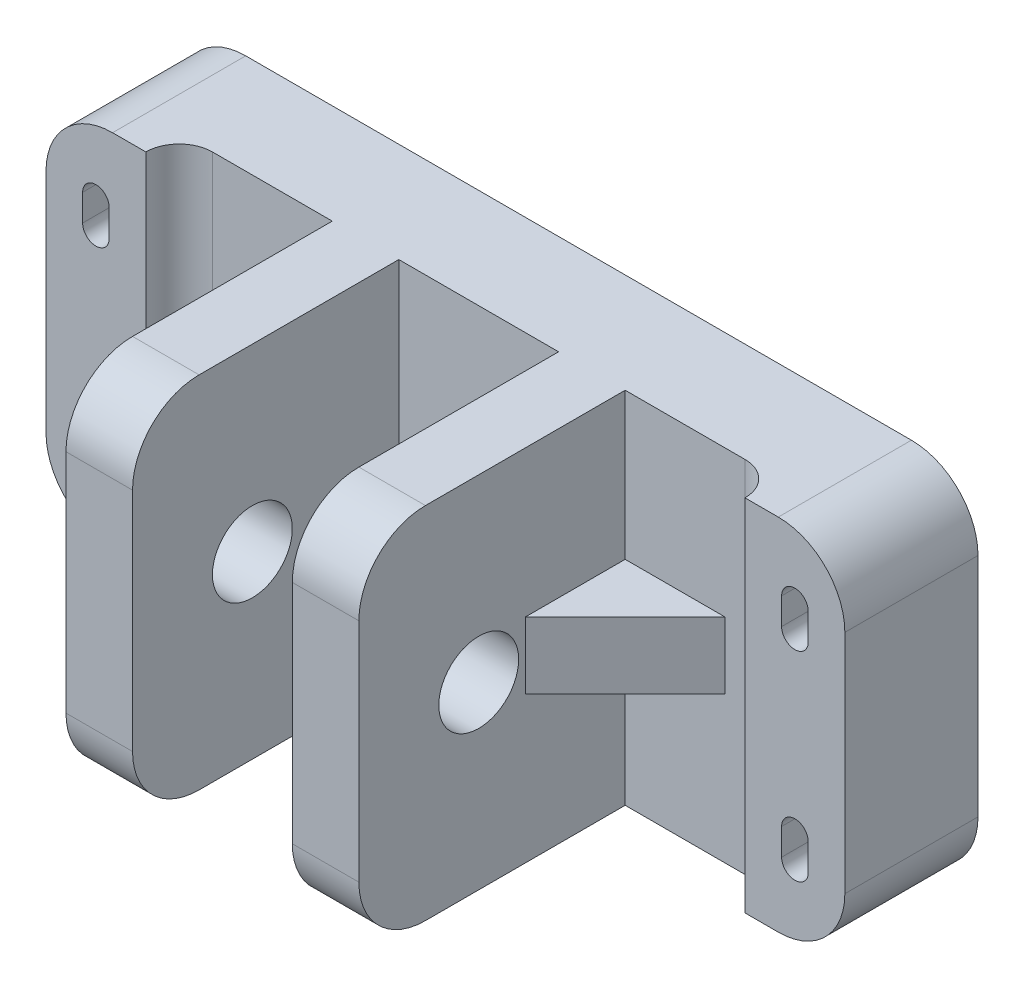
ISO-10303-21;
HEADER;
FILE_DESCRIPTION(('STEP AP214'),'2;1');
FILE_NAME('part.step','',(''),(''),'','','');
FILE_SCHEMA(('AUTOMOTIVE_DESIGN { 1 0 10303 214 1 1 1 1 }'));
ENDSEC;
DATA;
#1=APPLICATION_CONTEXT('core data for automotive mechanical design processes');
#2=APPLICATION_PROTOCOL_DEFINITION('international standard','automotive_design',2000,#1);
#3=PRODUCT_CONTEXT('',#1,'mechanical');
#4=PRODUCT('Part','Part','',(#3));
#5=PRODUCT_RELATED_PRODUCT_CATEGORY('part','',(#4));
#6=PRODUCT_DEFINITION_FORMATION('','',#4);
#7=PRODUCT_DEFINITION_CONTEXT('part definition',#1,'design');
#8=PRODUCT_DEFINITION('design','',#6,#7);
#9=PRODUCT_DEFINITION_SHAPE('','',#8);
#10=(LENGTH_UNIT() NAMED_UNIT(*) SI_UNIT(.MILLI.,.METRE.));
#11=(NAMED_UNIT(*) PLANE_ANGLE_UNIT() SI_UNIT($,.RADIAN.));
#12=(NAMED_UNIT(*) SI_UNIT($,.STERADIAN.) SOLID_ANGLE_UNIT());
#13=UNCERTAINTY_MEASURE_WITH_UNIT(LENGTH_MEASURE(1.E-05),#10,'distance_accuracy_value','');
#14=(GEOMETRIC_REPRESENTATION_CONTEXT(3) GLOBAL_UNCERTAINTY_ASSIGNED_CONTEXT((#13)) GLOBAL_UNIT_ASSIGNED_CONTEXT((#10,
#11,#12)) REPRESENTATION_CONTEXT('',''));
#15=CARTESIAN_POINT('',(0.,0.,0.));
#16=DIRECTION('',(0.,0.,1.));
#17=DIRECTION('',(1.,0.,0.));
#18=AXIS2_PLACEMENT_3D('',#15,#16,#17);
#19=CARTESIAN_POINT('',(22.,17.,45.));
#20=DIRECTION('',(-1.,0.,0.));
#21=DIRECTION('',(0.,0.,1.));
#22=AXIS2_PLACEMENT_3D('',#19,#20,#21);
#23=CYLINDRICAL_SURFACE('',#22,10.);
#24=DIRECTION('',(-1.,0.,0.));
#25=VECTOR('',#24,1.);
#26=CARTESIAN_POINT('',(22.,27.,44.9999999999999));
#27=LINE('',#26,#25);
#28=CARTESIAN_POINT('',(22.,27.,44.9999999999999));
#29=VERTEX_POINT('',#28);
#30=CARTESIAN_POINT('',(12.,27.,45.));
#31=VERTEX_POINT('',#30);
#32=EDGE_CURVE('E466',#29,#31,#27,.T.);
#33=ORIENTED_EDGE('',*,*,#32,.T.);
#34=CARTESIAN_POINT('',(12.,17.,45.));
#35=DIRECTION('',(1.,0.,0.));
#36=DIRECTION('',(0.,0.,-1.));
#37=AXIS2_PLACEMENT_3D('',#34,#35,#36);
#38=CIRCLE('',#37,10.);
#39=CARTESIAN_POINT('',(12.,16.9999999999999,55.));
#40=VERTEX_POINT('',#39);
#41=EDGE_CURVE('E417',#31,#40,#38,.T.);
#42=ORIENTED_EDGE('',*,*,#41,.T.);
#43=DIRECTION('',(-1.,0.,0.));
#44=VECTOR('',#43,1.);
#45=CARTESIAN_POINT('',(22.,16.9999999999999,55.));
#46=LINE('',#45,#44);
#47=CARTESIAN_POINT('',(22.,16.9999999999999,55.));
#48=VERTEX_POINT('',#47);
#49=EDGE_CURVE('E462',#48,#40,#46,.T.);
#50=ORIENTED_EDGE('',*,*,#49,.F.);
#51=CARTESIAN_POINT('',(22.,17.,45.));
#52=DIRECTION('',(1.,0.,0.));
#53=DIRECTION('',(0.,0.,-1.));
#54=AXIS2_PLACEMENT_3D('',#51,#52,#53);
#55=CIRCLE('',#54,10.);
#56=EDGE_CURVE('E428',#29,#48,#55,.T.);
#57=ORIENTED_EDGE('',*,*,#56,.F.);
#58=EDGE_LOOP('',(#33,#42,#50,#57));
#59=FACE_BOUND('',#58,.T.);
#60=ADVANCED_FACE('F37',(#59),#23,.T.);
#61=CARTESIAN_POINT('',(22.,16.9999999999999,55.));
#62=DIRECTION('',(0.,0.,-1.));
#63=DIRECTION('',(0.,1.,0.));
#64=AXIS2_PLACEMENT_3D('',#61,#62,#63);
#65=PLANE('',#64);
#66=ORIENTED_EDGE('',*,*,#49,.T.);
#67=DIRECTION('',(0.,-1.,0.));
#68=VECTOR('',#67,1.);
#69=CARTESIAN_POINT('',(12.,27.,55.));
#70=LINE('',#69,#68);
#71=CARTESIAN_POINT('',(12.,-17.,55.));
#72=VERTEX_POINT('',#71);
#73=EDGE_CURVE('E392',#40,#72,#70,.T.);
#74=ORIENTED_EDGE('',*,*,#73,.T.);
#75=DIRECTION('',(-1.,0.,0.));
#76=VECTOR('',#75,1.);
#77=CARTESIAN_POINT('',(22.,-16.9999999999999,55.));
#78=LINE('',#77,#76);
#79=CARTESIAN_POINT('',(22.,-16.9999999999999,55.));
#80=VERTEX_POINT('',#79);
#81=EDGE_CURVE('E458',#80,#72,#78,.T.);
#82=ORIENTED_EDGE('',*,*,#81,.F.);
#83=DIRECTION('',(0.,-1.,0.));
#84=VECTOR('',#83,1.);
#85=CARTESIAN_POINT('',(22.,16.9999999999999,55.));
#86=LINE('',#85,#84);
#87=EDGE_CURVE('E430',#48,#80,#86,.T.);
#88=ORIENTED_EDGE('',*,*,#87,.F.);
#89=EDGE_LOOP('',(#66,#74,#82,#88));
#90=FACE_BOUND('',#89,.T.);
#91=ADVANCED_FACE('F714',(#90),#65,.F.);
#92=CARTESIAN_POINT('',(22.,-17.,45.));
#93=DIRECTION('',(-1.,0.,0.));
#94=DIRECTION('',(0.,0.,1.));
#95=AXIS2_PLACEMENT_3D('',#92,#93,#94);
#96=CYLINDRICAL_SURFACE('',#95,10.);
#97=ORIENTED_EDGE('',*,*,#81,.T.);
#98=CARTESIAN_POINT('',(12.,-17.,45.));
#99=DIRECTION('',(1.,0.,0.));
#100=DIRECTION('',(0.,0.,-1.));
#101=AXIS2_PLACEMENT_3D('',#98,#99,#100);
#102=CIRCLE('',#101,10.);
#103=CARTESIAN_POINT('',(12.,-27.,45.));
#104=VERTEX_POINT('',#103);
#105=EDGE_CURVE('E414',#72,#104,#102,.T.);
#106=ORIENTED_EDGE('',*,*,#105,.T.);
#107=DIRECTION('',(-1.,0.,0.));
#108=VECTOR('',#107,1.);
#109=CARTESIAN_POINT('',(22.,-27.,44.9999999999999));
#110=LINE('',#109,#108);
#111=CARTESIAN_POINT('',(22.,-27.,44.9999999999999));
#112=VERTEX_POINT('',#111);
#113=EDGE_CURVE('E454',#112,#104,#110,.T.);
#114=ORIENTED_EDGE('',*,*,#113,.F.);
#115=CARTESIAN_POINT('',(22.,-17.,45.));
#116=DIRECTION('',(1.,0.,0.));
#117=DIRECTION('',(0.,0.,1.));
#118=AXIS2_PLACEMENT_3D('',#115,#116,#117);
#119=CIRCLE('',#118,10.);
#120=EDGE_CURVE('E432',#80,#112,#119,.T.);
#121=ORIENTED_EDGE('',*,*,#120,.F.);
#122=EDGE_LOOP('',(#97,#106,#114,#121));
#123=FACE_BOUND('',#122,.T.);
#124=ADVANCED_FACE('F719',(#123),#96,.T.);
#125=CARTESIAN_POINT('',(22.,0.,37.));
#126=DIRECTION('',(-1.,0.,0.));
#127=DIRECTION('',(0.,0.,1.));
#128=AXIS2_PLACEMENT_3D('',#125,#126,#127);
#129=CYLINDRICAL_SURFACE('',#128,6.);
#130=CARTESIAN_POINT('',(12.,0.,37.));
#131=DIRECTION('',(1.,0.,0.));
#132=DIRECTION('',(0.,0.,-1.));
#133=AXIS2_PLACEMENT_3D('',#130,#131,#132);
#134=CIRCLE('',#133,6.);
#135=CARTESIAN_POINT('',(12.,0.,31.));
#136=VERTEX_POINT('',#135);
#137=EDGE_CURVE('E41',#136,#136,#134,.T.);
#138=ORIENTED_EDGE('',*,*,#137,.F.);
#139=EDGE_LOOP('',(#138));
#140=FACE_BOUND('',#139,.T.);
#141=CARTESIAN_POINT('',(22.,0.,37.));
#142=DIRECTION('',(1.,0.,0.));
#143=DIRECTION('',(0.,0.,-1.));
#144=AXIS2_PLACEMENT_3D('',#141,#142,#143);
#145=CIRCLE('',#144,6.);
#146=CARTESIAN_POINT('',(22.,0.,31.));
#147=VERTEX_POINT('',#146);
#148=EDGE_CURVE('E421',#147,#147,#145,.T.);
#149=ORIENTED_EDGE('',*,*,#148,.T.);
#150=EDGE_LOOP('',(#149));
#151=FACE_BOUND('',#150,.T.);
#152=ADVANCED_FACE('F696',(#140,#151),#129,.F.);
#153=CARTESIAN_POINT('',(0.,0.,15.));
#154=DIRECTION('',(0.,0.,1.));
#155=DIRECTION('',(1.,0.,0.));
#156=AXIS2_PLACEMENT_3D('',#153,#154,#155);
#157=PLANE('',#156);
#158=DIRECTION('',(1.,0.,0.));
#159=VECTOR('',#158,1.);
#160=CARTESIAN_POINT('',(22.,4.99999999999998,15.));
#161=LINE('',#160,#159);
#162=CARTESIAN_POINT('',(22.,4.99999999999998,15.));
#163=VERTEX_POINT('',#162);
#164=CARTESIAN_POINT('',(37.,4.99999999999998,15.));
#165=VERTEX_POINT('',#164);
#166=EDGE_CURVE('E54',#163,#165,#161,.T.);
#167=ORIENTED_EDGE('',*,*,#166,.T.);
#168=DIRECTION('',(0.,-1.,0.));
#169=VECTOR('',#168,1.);
#170=CARTESIAN_POINT('',(37.,4.99999999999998,15.));
#171=LINE('',#170,#169);
#172=CARTESIAN_POINT('',(37.,-5.,15.));
#173=VERTEX_POINT('',#172);
#174=EDGE_CURVE('E58',#165,#173,#171,.T.);
#175=ORIENTED_EDGE('',*,*,#174,.T.);
#176=DIRECTION('',(1.,0.,0.));
#177=VECTOR('',#176,1.);
#178=CARTESIAN_POINT('',(22.,-5.,15.));
#179=LINE('',#178,#177);
#180=CARTESIAN_POINT('',(22.,-5.,15.));
#181=VERTEX_POINT('',#180);
#182=EDGE_CURVE('E342',#181,#173,#179,.T.);
#183=ORIENTED_EDGE('',*,*,#182,.F.);
#184=DIRECTION('',(0.,1.,0.));
#185=VECTOR('',#184,1.);
#186=CARTESIAN_POINT('',(22.,27.,15.));
#187=LINE('',#186,#185);
#188=CARTESIAN_POINT('',(22.,-27.,15.));
#189=VERTEX_POINT('',#188);
#190=EDGE_CURVE('E331',#189,#181,#187,.T.);
#191=ORIENTED_EDGE('',*,*,#190,.F.);
#192=DIRECTION('',(1.,0.,0.));
#193=VECTOR('',#192,1.);
#194=CARTESIAN_POINT('',(0.,-27.,15.));
#195=LINE('',#194,#193);
#196=CARTESIAN_POINT('',(40.,-27.,15.));
#197=VERTEX_POINT('',#196);
#198=EDGE_CURVE('E569',#189,#197,#195,.T.);
#199=ORIENTED_EDGE('',*,*,#198,.T.);
#200=DIRECTION('',(0.,-1.,0.));
#201=VECTOR('',#200,1.);
#202=CARTESIAN_POINT('',(40.,0.,15.));
#203=LINE('',#202,#201);
#204=CARTESIAN_POINT('',(40.,27.,15.));
#205=VERTEX_POINT('',#204);
#206=EDGE_CURVE('E676',#197,#205,#203,.F.);
#207=ORIENTED_EDGE('',*,*,#206,.T.);
#208=DIRECTION('',(1.,0.,0.));
#209=VECTOR('',#208,1.);
#210=CARTESIAN_POINT('',(0.,27.,15.));
#211=LINE('',#210,#209);
#212=CARTESIAN_POINT('',(22.,27.,15.));
#213=VERTEX_POINT('',#212);
#214=EDGE_CURVE('E548',#213,#205,#211,.T.);
#215=ORIENTED_EDGE('',*,*,#214,.F.);
#216=EDGE_CURVE('E340',#163,#213,#187,.T.);
#217=ORIENTED_EDGE('',*,*,#216,.F.);
#218=EDGE_LOOP('',(#167,#175,#183,#191,#199,#207,#215,#217));
#219=FACE_BOUND('',#218,.T.);
#220=ADVANCED_FACE('F343',(#219),#157,.T.);
#221=CARTESIAN_POINT('',(-52.5,13.,20.));
#222=DIRECTION('',(0.,0.,-1.));
#223=DIRECTION('',(-1.,0.,0.));
#224=AXIS2_PLACEMENT_3D('',#221,#222,#223);
#225=CYLINDRICAL_SURFACE('',#224,1.99999999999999);
#226=CARTESIAN_POINT('',(-52.5,13.,0.));
#227=DIRECTION('',(0.,0.,1.));
#228=DIRECTION('',(1.,0.,0.));
#229=AXIS2_PLACEMENT_3D('',#226,#227,#228);
#230=CIRCLE('',#229,1.99999999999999);
#231=CARTESIAN_POINT('',(-54.5,13.,0.));
#232=VERTEX_POINT('',#231);
#233=CARTESIAN_POINT('',(-50.5,13.,0.));
#234=VERTEX_POINT('',#233);
#235=EDGE_CURVE('E637',#232,#234,#230,.T.);
#236=ORIENTED_EDGE('',*,*,#235,.F.);
#237=DIRECTION('',(0.,0.,-1.));
#238=VECTOR('',#237,1.);
#239=CARTESIAN_POINT('',(-54.5,13.,20.));
#240=LINE('',#239,#238);
#241=CARTESIAN_POINT('',(-54.5,13.,20.));
#242=VERTEX_POINT('',#241);
#243=EDGE_CURVE('E655',#242,#232,#240,.T.);
#244=ORIENTED_EDGE('',*,*,#243,.F.);
#245=CARTESIAN_POINT('',(-52.5,13.,20.));
#246=DIRECTION('',(0.,0.,1.));
#247=DIRECTION('',(1.,0.,0.));
#248=AXIS2_PLACEMENT_3D('',#245,#246,#247);
#249=CIRCLE('',#248,1.99999999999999);
#250=CARTESIAN_POINT('',(-50.5,13.,20.));
#251=VERTEX_POINT('',#250);
#252=EDGE_CURVE('E602',#242,#251,#249,.T.);
#253=ORIENTED_EDGE('',*,*,#252,.T.);
#254=DIRECTION('',(0.,0.,-1.));
#255=VECTOR('',#254,1.);
#256=CARTESIAN_POINT('',(-50.5,13.,20.));
#257=LINE('',#256,#255);
#258=EDGE_CURVE('E648',#251,#234,#257,.T.);
#259=ORIENTED_EDGE('',*,*,#258,.T.);
#260=EDGE_LOOP('',(#236,#244,#253,#259));
#261=FACE_BOUND('',#260,.T.);
#262=ADVANCED_FACE('F797',(#261),#225,.F.);
#263=CARTESIAN_POINT('',(-54.5,0.,20.));
#264=DIRECTION('',(1.,0.,0.));
#265=DIRECTION('',(0.,0.,-1.));
#266=AXIS2_PLACEMENT_3D('',#263,#264,#265);
#267=PLANE('',#266);
#268=DIRECTION('',(0.,-1.,0.));
#269=VECTOR('',#268,1.);
#270=CARTESIAN_POINT('',(-54.5,0.,0.));
#271=LINE('',#270,#269);
#272=CARTESIAN_POINT('',(-54.5,17.,0.));
#273=VERTEX_POINT('',#272);
#274=EDGE_CURVE('E640',#273,#232,#271,.T.);
#275=ORIENTED_EDGE('',*,*,#274,.F.);
#276=DIRECTION('',(0.,0.,-1.));
#277=VECTOR('',#276,1.);
#278=CARTESIAN_POINT('',(-54.5,17.,20.));
#279=LINE('',#278,#277);
#280=CARTESIAN_POINT('',(-54.5,17.,20.));
#281=VERTEX_POINT('',#280);
#282=EDGE_CURVE('E653',#281,#273,#279,.T.);
#283=ORIENTED_EDGE('',*,*,#282,.F.);
#284=DIRECTION('',(0.,-1.,0.));
#285=VECTOR('',#284,1.);
#286=CARTESIAN_POINT('',(-54.5,0.,20.));
#287=LINE('',#286,#285);
#288=EDGE_CURVE('E605',#281,#242,#287,.T.);
#289=ORIENTED_EDGE('',*,*,#288,.T.);
#290=ORIENTED_EDGE('',*,*,#243,.T.);
#291=EDGE_LOOP('',(#275,#283,#289,#290));
#292=FACE_BOUND('',#291,.T.);
#293=ADVANCED_FACE('F793',(#292),#267,.T.);
#294=CARTESIAN_POINT('',(-52.5,17.,20.));
#295=DIRECTION('',(0.,0.,-1.));
#296=DIRECTION('',(-1.,0.,0.));
#297=AXIS2_PLACEMENT_3D('',#294,#295,#296);
#298=CYLINDRICAL_SURFACE('',#297,1.99999999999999);
#299=CARTESIAN_POINT('',(-52.5,17.,0.));
#300=DIRECTION('',(0.,0.,1.));
#301=DIRECTION('',(1.,0.,0.));
#302=AXIS2_PLACEMENT_3D('',#299,#300,#301);
#303=CIRCLE('',#302,1.99999999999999);
#304=CARTESIAN_POINT('',(-50.5,17.,0.));
#305=VERTEX_POINT('',#304);
#306=EDGE_CURVE('E643',#305,#273,#303,.T.);
#307=ORIENTED_EDGE('',*,*,#306,.F.);
#308=DIRECTION('',(0.,0.,-1.));
#309=VECTOR('',#308,1.);
#310=CARTESIAN_POINT('',(-50.5,17.,20.));
#311=LINE('',#310,#309);
#312=CARTESIAN_POINT('',(-50.5,17.,20.));
#313=VERTEX_POINT('',#312);
#314=EDGE_CURVE('E650',#313,#305,#311,.T.);
#315=ORIENTED_EDGE('',*,*,#314,.F.);
#316=CARTESIAN_POINT('',(-52.5,17.,20.));
#317=DIRECTION('',(0.,0.,1.));
#318=DIRECTION('',(1.,0.,0.));
#319=AXIS2_PLACEMENT_3D('',#316,#317,#318);
#320=CIRCLE('',#319,1.99999999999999);
#321=EDGE_CURVE('E608',#313,#281,#320,.T.);
#322=ORIENTED_EDGE('',*,*,#321,.T.);
#323=ORIENTED_EDGE('',*,*,#282,.T.);
#324=EDGE_LOOP('',(#307,#315,#322,#323));
#325=FACE_BOUND('',#324,.T.);
#326=ADVANCED_FACE('F789',(#325),#298,.F.);
#327=CARTESIAN_POINT('',(-54.5,0.,20.));
#328=DIRECTION('',(-1.,0.,0.));
#329=DIRECTION('',(0.,0.,1.));
#330=AXIS2_PLACEMENT_3D('',#327,#328,#329);
#331=PLANE('',#330);
#332=DIRECTION('',(0.,1.,0.));
#333=VECTOR('',#332,1.);
#334=CARTESIAN_POINT('',(-54.5,0.,0.));
#335=LINE('',#334,#333);
#336=CARTESIAN_POINT('',(-54.5,-17.,0.));
#337=VERTEX_POINT('',#336);
#338=CARTESIAN_POINT('',(-54.5,-13.,0.));
#339=VERTEX_POINT('',#338);
#340=EDGE_CURVE('E626',#337,#339,#335,.T.);
#341=ORIENTED_EDGE('',*,*,#340,.T.);
#342=DIRECTION('',(0.,0.,-1.));
#343=VECTOR('',#342,1.);
#344=CARTESIAN_POINT('',(-54.5,-13.,20.));
#345=LINE('',#344,#343);
#346=CARTESIAN_POINT('',(-54.5,-13.,20.));
#347=VERTEX_POINT('',#346);
#348=EDGE_CURVE('E651',#347,#339,#345,.T.);
#349=ORIENTED_EDGE('',*,*,#348,.F.);
#350=DIRECTION('',(0.,1.,0.));
#351=VECTOR('',#350,1.);
#352=CARTESIAN_POINT('',(-54.5,0.,20.));
#353=LINE('',#352,#351);
#354=CARTESIAN_POINT('',(-54.5,-17.,20.));
#355=VERTEX_POINT('',#354);
#356=EDGE_CURVE('E592',#355,#347,#353,.T.);
#357=ORIENTED_EDGE('',*,*,#356,.F.);
#358=DIRECTION('',(0.,0.,-1.));
#359=VECTOR('',#358,1.);
#360=CARTESIAN_POINT('',(-54.5,-17.,20.));
#361=LINE('',#360,#359);
#362=EDGE_CURVE('E658',#355,#337,#361,.T.);
#363=ORIENTED_EDGE('',*,*,#362,.T.);
#364=EDGE_LOOP('',(#341,#349,#357,#363));
#365=FACE_BOUND('',#364,.T.);
#366=ADVANCED_FACE('F792',(#365),#331,.F.);
#367=CARTESIAN_POINT('',(-52.5,-13.,20.));
#368=DIRECTION('',(0.,0.,-1.));
#369=DIRECTION('',(-1.,0.,0.));
#370=AXIS2_PLACEMENT_3D('',#367,#368,#369);
#371=CYLINDRICAL_SURFACE('',#370,1.99999999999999);
#372=CARTESIAN_POINT('',(-52.5,-13.,0.));
#373=DIRECTION('',(0.,0.,1.));
#374=DIRECTION('',(1.,0.,0.));
#375=AXIS2_PLACEMENT_3D('',#372,#373,#374);
#376=CIRCLE('',#375,1.99999999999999);
#377=CARTESIAN_POINT('',(-50.5,-13.,0.));
#378=VERTEX_POINT('',#377);
#379=EDGE_CURVE('E629',#339,#378,#376,.F.);
#380=ORIENTED_EDGE('',*,*,#379,.T.);
#381=DIRECTION('',(0.,0.,-1.));
#382=VECTOR('',#381,1.);
#383=CARTESIAN_POINT('',(-50.5,-13.,20.));
#384=LINE('',#383,#382);
#385=CARTESIAN_POINT('',(-50.5,-13.,20.));
#386=VERTEX_POINT('',#385);
#387=EDGE_CURVE('E664',#386,#378,#384,.T.);
#388=ORIENTED_EDGE('',*,*,#387,.F.);
#389=CARTESIAN_POINT('',(-52.5,-13.,20.));
#390=DIRECTION('',(0.,0.,1.));
#391=DIRECTION('',(1.,0.,0.));
#392=AXIS2_PLACEMENT_3D('',#389,#390,#391);
#393=CIRCLE('',#392,1.99999999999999);
#394=EDGE_CURVE('E595',#347,#386,#393,.F.);
#395=ORIENTED_EDGE('',*,*,#394,.F.);
#396=ORIENTED_EDGE('',*,*,#348,.T.);
#397=EDGE_LOOP('',(#380,#388,#395,#396));
#398=FACE_BOUND('',#397,.T.);
#399=ADVANCED_FACE('F811',(#398),#371,.F.);
#400=CARTESIAN_POINT('',(-50.5,0.,20.));
#401=DIRECTION('',(-1.,0.,0.));
#402=DIRECTION('',(0.,0.,1.));
#403=AXIS2_PLACEMENT_3D('',#400,#401,#402);
#404=PLANE('',#403);
#405=DIRECTION('',(0.,1.,0.));
#406=VECTOR('',#405,1.);
#407=CARTESIAN_POINT('',(-50.5,0.,0.));
#408=LINE('',#407,#406);
#409=CARTESIAN_POINT('',(-50.5,-17.,0.));
#410=VERTEX_POINT('',#409);
#411=EDGE_CURVE('E632',#410,#378,#408,.T.);
#412=ORIENTED_EDGE('',*,*,#411,.F.);
#413=DIRECTION('',(0.,0.,-1.));
#414=VECTOR('',#413,1.);
#415=CARTESIAN_POINT('',(-50.5,-17.,20.));
#416=LINE('',#415,#414);
#417=CARTESIAN_POINT('',(-50.5,-17.,20.));
#418=VERTEX_POINT('',#417);
#419=EDGE_CURVE('E661',#418,#410,#416,.T.);
#420=ORIENTED_EDGE('',*,*,#419,.F.);
#421=DIRECTION('',(0.,1.,0.));
#422=VECTOR('',#421,1.);
#423=CARTESIAN_POINT('',(-50.5,0.,20.));
#424=LINE('',#423,#422);
#425=EDGE_CURVE('E597',#418,#386,#424,.T.);
#426=ORIENTED_EDGE('',*,*,#425,.T.);
#427=ORIENTED_EDGE('',*,*,#387,.T.);
#428=EDGE_LOOP('',(#412,#420,#426,#427));
#429=FACE_BOUND('',#428,.T.);
#430=ADVANCED_FACE('F807',(#429),#404,.T.);
#431=CARTESIAN_POINT('',(-50.,17.,20.));
#432=DIRECTION('',(0.,0.,-1.));
#433=DIRECTION('',(-1.,0.,0.));
#434=AXIS2_PLACEMENT_3D('',#431,#432,#433);
#435=CYLINDRICAL_SURFACE('',#434,10.);
#436=CARTESIAN_POINT('',(-50.,17.,0.));
#437=DIRECTION('',(0.,0.,1.));
#438=DIRECTION('',(1.,0.,0.));
#439=AXIS2_PLACEMENT_3D('',#436,#437,#438);
#440=CIRCLE('',#439,10.);
#441=CARTESIAN_POINT('',(-60.,17.,0.));
#442=VERTEX_POINT('',#441);
#443=CARTESIAN_POINT('',(-50.,27.,0.));
#444=VERTEX_POINT('',#443);
#445=EDGE_CURVE('E572',#442,#444,#440,.F.);
#446=ORIENTED_EDGE('',*,*,#445,.F.);
#447=DIRECTION('',(0.,0.,-1.));
#448=VECTOR('',#447,1.);
#449=CARTESIAN_POINT('',(-60.,17.,20.));
#450=LINE('',#449,#448);
#451=CARTESIAN_POINT('',(-60.,17.,20.));
#452=VERTEX_POINT('',#451);
#453=EDGE_CURVE('E662',#452,#442,#450,.T.);
#454=ORIENTED_EDGE('',*,*,#453,.F.);
#455=CARTESIAN_POINT('',(-50.,17.,20.));
#456=DIRECTION('',(0.,0.,1.));
#457=DIRECTION('',(1.,0.,0.));
#458=AXIS2_PLACEMENT_3D('',#455,#456,#457);
#459=CIRCLE('',#458,10.);
#460=CARTESIAN_POINT('',(-50.,27.,20.));
#461=VERTEX_POINT('',#460);
#462=EDGE_CURVE('E573',#452,#461,#459,.F.);
#463=ORIENTED_EDGE('',*,*,#462,.T.);
#464=DIRECTION('',(0.,0.,-1.));
#465=VECTOR('',#464,1.);
#466=CARTESIAN_POINT('',(-50.,27.,20.));
#467=LINE('',#466,#465);
#468=EDGE_CURVE('E613',#461,#444,#467,.T.);
#469=ORIENTED_EDGE('',*,*,#468,.T.);
#470=EDGE_LOOP('',(#446,#454,#463,#469));
#471=FACE_BOUND('',#470,.T.);
#472=ADVANCED_FACE('F810',(#471),#435,.T.);
#473=CARTESIAN_POINT('',(-60.,0.,20.));
#474=DIRECTION('',(-1.,0.,0.));
#475=DIRECTION('',(0.,0.,1.));
#476=AXIS2_PLACEMENT_3D('',#473,#474,#475);
#477=PLANE('',#476);
#478=DIRECTION('',(0.,1.,0.));
#479=VECTOR('',#478,1.);
#480=CARTESIAN_POINT('',(-60.,0.,0.));
#481=LINE('',#480,#479);
#482=CARTESIAN_POINT('',(-60.,-17.,0.));
#483=VERTEX_POINT('',#482);
#484=EDGE_CURVE('E616',#483,#442,#481,.T.);
#485=ORIENTED_EDGE('',*,*,#484,.F.);
#486=DIRECTION('',(0.,0.,-1.));
#487=VECTOR('',#486,1.);
#488=CARTESIAN_POINT('',(-60.,-17.,20.));
#489=LINE('',#488,#487);
#490=CARTESIAN_POINT('',(-60.,-17.,20.));
#491=VERTEX_POINT('',#490);
#492=EDGE_CURVE('E671',#491,#483,#489,.T.);
#493=ORIENTED_EDGE('',*,*,#492,.F.);
#494=DIRECTION('',(0.,1.,0.));
#495=VECTOR('',#494,1.);
#496=CARTESIAN_POINT('',(-60.,0.,20.));
#497=LINE('',#496,#495);
#498=EDGE_CURVE('E576',#491,#452,#497,.T.);
#499=ORIENTED_EDGE('',*,*,#498,.T.);
#500=ORIENTED_EDGE('',*,*,#453,.T.);
#501=EDGE_LOOP('',(#485,#493,#499,#500));
#502=FACE_BOUND('',#501,.T.);
#503=ADVANCED_FACE('F828',(#502),#477,.T.);
#504=CARTESIAN_POINT('',(-50.,-17.,20.));
#505=DIRECTION('',(0.,0.,-1.));
#506=DIRECTION('',(-1.,0.,0.));
#507=AXIS2_PLACEMENT_3D('',#504,#505,#506);
#508=CYLINDRICAL_SURFACE('',#507,10.);
#509=CARTESIAN_POINT('',(-50.,-17.,0.));
#510=DIRECTION('',(0.,0.,1.));
#511=DIRECTION('',(1.,0.,0.));
#512=AXIS2_PLACEMENT_3D('',#509,#510,#511);
#513=CIRCLE('',#512,10.);
#514=CARTESIAN_POINT('',(-50.,-27.,0.));
#515=VERTEX_POINT('',#514);
#516=EDGE_CURVE('E619',#515,#483,#513,.F.);
#517=ORIENTED_EDGE('',*,*,#516,.F.);
#518=DIRECTION('',(0.,0.,-1.));
#519=VECTOR('',#518,1.);
#520=CARTESIAN_POINT('',(-50.,-27.,20.));
#521=LINE('',#520,#519);
#522=CARTESIAN_POINT('',(-50.,-27.,20.));
#523=VERTEX_POINT('',#522);
#524=EDGE_CURVE('E669',#523,#515,#521,.T.);
#525=ORIENTED_EDGE('',*,*,#524,.F.);
#526=CARTESIAN_POINT('',(-50.,-17.,20.));
#527=DIRECTION('',(0.,0.,1.));
#528=DIRECTION('',(1.,0.,0.));
#529=AXIS2_PLACEMENT_3D('',#526,#527,#528);
#530=CIRCLE('',#529,10.);
#531=EDGE_CURVE('E580',#523,#491,#530,.F.);
#532=ORIENTED_EDGE('',*,*,#531,.T.);
#533=ORIENTED_EDGE('',*,*,#492,.T.);
#534=EDGE_LOOP('',(#517,#525,#532,#533));
#535=FACE_BOUND('',#534,.T.);
#536=ADVANCED_FACE('F824',(#535),#508,.T.);
#537=CARTESIAN_POINT('',(0.,-27.,20.));
#538=DIRECTION('',(0.,1.,0.));
#539=DIRECTION('',(0.,0.,1.));
#540=AXIS2_PLACEMENT_3D('',#537,#538,#539);
#541=PLANE('',#540);
#542=ORIENTED_EDGE('',*,*,#113,.T.);
#543=DIRECTION('',(0.,0.,1.));
#544=VECTOR('',#543,1.);
#545=CARTESIAN_POINT('',(12.,-27.,15.));
#546=LINE('',#545,#544);
#547=CARTESIAN_POINT('',(12.,-27.,15.));
#548=VERTEX_POINT('',#547);
#549=EDGE_CURVE('E379',#548,#104,#546,.T.);
#550=ORIENTED_EDGE('',*,*,#549,.F.);
#551=DIRECTION('',(1.,0.,0.));
#552=VECTOR('',#551,1.);
#553=CARTESIAN_POINT('',(12.,-27.,15.));
#554=LINE('',#553,#552);
#555=CARTESIAN_POINT('',(-12.,-27.,15.));
#556=VERTEX_POINT('',#555);
#557=EDGE_CURVE('E386',#556,#548,#554,.T.);
#558=ORIENTED_EDGE('',*,*,#557,.F.);
#559=DIRECTION('',(0.,0.,-1.));
#560=VECTOR('',#559,1.);
#561=CARTESIAN_POINT('',(-12.,-27.,15.));
#562=LINE('',#561,#560);
#563=CARTESIAN_POINT('',(-12.,-27.,45.));
#564=VERTEX_POINT('',#563);
#565=EDGE_CURVE('E394',#564,#556,#562,.T.);
#566=ORIENTED_EDGE('',*,*,#565,.F.);
#567=CARTESIAN_POINT('',(-22.,-27.,44.9999999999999));
#568=VERTEX_POINT('',#567);
#569=EDGE_CURVE('E435',#564,#568,#110,.T.);
#570=ORIENTED_EDGE('',*,*,#569,.T.);
#571=DIRECTION('',(0.,0.,-1.));
#572=VECTOR('',#571,1.);
#573=CARTESIAN_POINT('',(-22.,-27.,15.));
#574=LINE('',#573,#572);
#575=CARTESIAN_POINT('',(-22.,-27.,15.));
#576=VERTEX_POINT('',#575);
#577=EDGE_CURVE('E451',#568,#576,#574,.T.);
#578=ORIENTED_EDGE('',*,*,#577,.T.);
#579=CARTESIAN_POINT('',(-40.,-27.,15.));
#580=VERTEX_POINT('',#579);
#581=EDGE_CURVE('E570',#580,#576,#195,.T.);
#582=ORIENTED_EDGE('',*,*,#581,.F.);
#583=CARTESIAN_POINT('',(-40.,-27.,20.));
#584=DIRECTION('',(0.,1.,0.));
#585=DIRECTION('',(0.,0.,1.));
#586=AXIS2_PLACEMENT_3D('',#583,#584,#585);
#587=CIRCLE('',#586,5.);
#588=CARTESIAN_POINT('',(-45.,-27.,20.));
#589=VERTEX_POINT('',#588);
#590=EDGE_CURVE('E46',#580,#589,#587,.T.);
#591=ORIENTED_EDGE('',*,*,#590,.T.);
#592=DIRECTION('',(1.,0.,0.));
#593=VECTOR('',#592,1.);
#594=CARTESIAN_POINT('',(0.,-27.,20.));
#595=LINE('',#594,#593);
#596=EDGE_CURVE('E583',#523,#589,#595,.T.);
#597=ORIENTED_EDGE('',*,*,#596,.F.);
#598=ORIENTED_EDGE('',*,*,#524,.T.);
#599=DIRECTION('',(1.,0.,0.));
#600=VECTOR('',#599,1.);
#601=CARTESIAN_POINT('',(0.,-27.,0.));
#602=LINE('',#601,#600);
#603=CARTESIAN_POINT('',(50.,-27.,0.));
#604=VERTEX_POINT('',#603);
#605=EDGE_CURVE('E622',#515,#604,#602,.T.);
#606=ORIENTED_EDGE('',*,*,#605,.T.);
#607=DIRECTION('',(0.,0.,-1.));
#608=VECTOR('',#607,1.);
#609=CARTESIAN_POINT('',(50.,-27.,20.));
#610=LINE('',#609,#608);
#611=CARTESIAN_POINT('',(50.,-27.,20.));
#612=VERTEX_POINT('',#611);
#613=EDGE_CURVE('E561',#612,#604,#610,.T.);
#614=ORIENTED_EDGE('',*,*,#613,.F.);
#615=DIRECTION('',(1.,0.,0.));
#616=VECTOR('',#615,1.);
#617=CARTESIAN_POINT('',(0.,-27.,20.));
#618=LINE('',#617,#616);
#619=CARTESIAN_POINT('',(45.,-27.,20.));
#620=VERTEX_POINT('',#619);
#621=EDGE_CURVE('E480',#620,#612,#618,.T.);
#622=ORIENTED_EDGE('',*,*,#621,.F.);
#623=CARTESIAN_POINT('',(40.,-27.,20.));
#624=DIRECTION('',(0.,1.,0.));
#625=DIRECTION('',(0.,0.,1.));
#626=AXIS2_PLACEMENT_3D('',#623,#624,#625);
#627=CIRCLE('',#626,5.);
#628=EDGE_CURVE('E679',#620,#197,#627,.T.);
#629=ORIENTED_EDGE('',*,*,#628,.T.);
#630=ORIENTED_EDGE('',*,*,#198,.F.);
#631=DIRECTION('',(0.,0.,-1.));
#632=VECTOR('',#631,1.);
#633=CARTESIAN_POINT('',(22.,-27.,15.));
#634=LINE('',#633,#632);
#635=EDGE_CURVE('E338',#112,#189,#634,.T.);
#636=ORIENTED_EDGE('',*,*,#635,.F.);
#637=EDGE_LOOP('',(#542,#550,#558,#566,#570,#578,#582,#591,#597,#598,#606,#614,#622,#629,#630,#636));
#638=FACE_BOUND('',#637,.T.);
#639=ADVANCED_FACE('F805',(#638),#541,.F.);
#640=CARTESIAN_POINT('',(-52.5,-17.,20.));
#641=DIRECTION('',(0.,0.,-1.));
#642=DIRECTION('',(-1.,0.,0.));
#643=AXIS2_PLACEMENT_3D('',#640,#641,#642);
#644=CYLINDRICAL_SURFACE('',#643,1.99999999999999);
#645=CARTESIAN_POINT('',(-52.5,-17.,0.));
#646=DIRECTION('',(0.,0.,1.));
#647=DIRECTION('',(1.,0.,0.));
#648=AXIS2_PLACEMENT_3D('',#645,#646,#647);
#649=CIRCLE('',#648,1.99999999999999);
#650=EDGE_CURVE('E635',#410,#337,#649,.F.);
#651=ORIENTED_EDGE('',*,*,#650,.T.);
#652=ORIENTED_EDGE('',*,*,#362,.F.);
#653=CARTESIAN_POINT('',(-52.5,-17.,20.));
#654=DIRECTION('',(0.,0.,1.));
#655=DIRECTION('',(1.,0.,0.));
#656=AXIS2_PLACEMENT_3D('',#653,#654,#655);
#657=CIRCLE('',#656,1.99999999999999);
#658=EDGE_CURVE('E600',#418,#355,#657,.F.);
#659=ORIENTED_EDGE('',*,*,#658,.F.);
#660=ORIENTED_EDGE('',*,*,#419,.T.);
#661=EDGE_LOOP('',(#651,#652,#659,#660));
#662=FACE_BOUND('',#661,.T.);
#663=ADVANCED_FACE('F802',(#662),#644,.F.);
#664=CARTESIAN_POINT('',(0.,27.,20.));
#665=DIRECTION('',(0.,1.,0.));
#666=DIRECTION('',(0.,0.,1.));
#667=AXIS2_PLACEMENT_3D('',#664,#665,#666);
#668=PLANE('',#667);
#669=DIRECTION('',(0.,0.,1.));
#670=VECTOR('',#669,1.);
#671=CARTESIAN_POINT('',(12.,27.,15.));
#672=LINE('',#671,#670);
#673=CARTESIAN_POINT('',(12.,27.,15.));
#674=VERTEX_POINT('',#673);
#675=EDGE_CURVE('E382',#674,#31,#672,.T.);
#676=ORIENTED_EDGE('',*,*,#675,.T.);
#677=ORIENTED_EDGE('',*,*,#32,.F.);
#678=DIRECTION('',(0.,0.,1.));
#679=VECTOR('',#678,1.);
#680=CARTESIAN_POINT('',(22.,27.,15.));
#681=LINE('',#680,#679);
#682=EDGE_CURVE('E339',#213,#29,#681,.T.);
#683=ORIENTED_EDGE('',*,*,#682,.F.);
#684=ORIENTED_EDGE('',*,*,#214,.T.);
#685=CARTESIAN_POINT('',(40.,27.,20.));
#686=DIRECTION('',(0.,1.,0.));
#687=DIRECTION('',(0.,0.,1.));
#688=AXIS2_PLACEMENT_3D('',#685,#686,#687);
#689=CIRCLE('',#688,5.);
#690=CARTESIAN_POINT('',(45.,27.,20.));
#691=VERTEX_POINT('',#690);
#692=EDGE_CURVE('E682',#205,#691,#689,.F.);
#693=ORIENTED_EDGE('',*,*,#692,.T.);
#694=DIRECTION('',(1.,0.,0.));
#695=VECTOR('',#694,1.);
#696=CARTESIAN_POINT('',(0.,27.,20.));
#697=LINE('',#696,#695);
#698=CARTESIAN_POINT('',(50.,27.,20.));
#699=VERTEX_POINT('',#698);
#700=EDGE_CURVE('E473',#691,#699,#697,.T.);
#701=ORIENTED_EDGE('',*,*,#700,.T.);
#702=DIRECTION('',(0.,0.,-1.));
#703=VECTOR('',#702,1.);
#704=CARTESIAN_POINT('',(50.,27.,20.));
#705=LINE('',#704,#703);
#706=CARTESIAN_POINT('',(50.,27.,0.));
#707=VERTEX_POINT('',#706);
#708=EDGE_CURVE('E552',#699,#707,#705,.T.);
#709=ORIENTED_EDGE('',*,*,#708,.T.);
#710=DIRECTION('',(1.,0.,0.));
#711=VECTOR('',#710,1.);
#712=CARTESIAN_POINT('',(0.,27.,0.));
#713=LINE('',#712,#711);
#714=EDGE_CURVE('E624',#444,#707,#713,.T.);
#715=ORIENTED_EDGE('',*,*,#714,.F.);
#716=ORIENTED_EDGE('',*,*,#468,.F.);
#717=DIRECTION('',(1.,0.,0.));
#718=VECTOR('',#717,1.);
#719=CARTESIAN_POINT('',(0.,27.,20.));
#720=LINE('',#719,#718);
#721=CARTESIAN_POINT('',(-45.,27.,20.));
#722=VERTEX_POINT('',#721);
#723=EDGE_CURVE('E589',#461,#722,#720,.T.);
#724=ORIENTED_EDGE('',*,*,#723,.T.);
#725=CARTESIAN_POINT('',(-40.,27.,20.));
#726=DIRECTION('',(0.,1.,0.));
#727=DIRECTION('',(0.,0.,1.));
#728=AXIS2_PLACEMENT_3D('',#725,#726,#727);
#729=CIRCLE('',#728,5.);
#730=CARTESIAN_POINT('',(-40.,27.,15.));
#731=VERTEX_POINT('',#730);
#732=EDGE_CURVE('E11',#722,#731,#729,.F.);
#733=ORIENTED_EDGE('',*,*,#732,.T.);
#734=CARTESIAN_POINT('',(-22.,27.,15.));
#735=VERTEX_POINT('',#734);
#736=EDGE_CURVE('E566',#731,#735,#211,.T.);
#737=ORIENTED_EDGE('',*,*,#736,.T.);
#738=DIRECTION('',(0.,0.,1.));
#739=VECTOR('',#738,1.);
#740=CARTESIAN_POINT('',(-22.,27.,15.));
#741=LINE('',#740,#739);
#742=CARTESIAN_POINT('',(-22.,27.,44.9999999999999));
#743=VERTEX_POINT('',#742);
#744=EDGE_CURVE('E439',#735,#743,#741,.T.);
#745=ORIENTED_EDGE('',*,*,#744,.T.);
#746=CARTESIAN_POINT('',(-12.,27.,45.));
#747=VERTEX_POINT('',#746);
#748=EDGE_CURVE('E465',#747,#743,#27,.T.);
#749=ORIENTED_EDGE('',*,*,#748,.F.);
#750=DIRECTION('',(0.,0.,-1.));
#751=VECTOR('',#750,1.);
#752=CARTESIAN_POINT('',(-12.,27.,15.));
#753=LINE('',#752,#751);
#754=CARTESIAN_POINT('',(-12.,27.,15.));
#755=VERTEX_POINT('',#754);
#756=EDGE_CURVE('E385',#747,#755,#753,.T.);
#757=ORIENTED_EDGE('',*,*,#756,.T.);
#758=DIRECTION('',(1.,0.,0.));
#759=VECTOR('',#758,1.);
#760=CARTESIAN_POINT('',(12.,27.,15.));
#761=LINE('',#760,#759);
#762=EDGE_CURVE('E389',#755,#674,#761,.T.);
#763=ORIENTED_EDGE('',*,*,#762,.T.);
#764=EDGE_LOOP('',(#676,#677,#683,#684,#693,#701,#709,#715,#716,#724,#733,#737,#745,#749,#757,#763));
#765=FACE_BOUND('',#764,.T.);
#766=ADVANCED_FACE('F787',(#765),#668,.T.);
#767=CARTESIAN_POINT('',(-50.5,0.,20.));
#768=DIRECTION('',(1.,0.,0.));
#769=DIRECTION('',(0.,0.,-1.));
#770=AXIS2_PLACEMENT_3D('',#767,#768,#769);
#771=PLANE('',#770);
#772=DIRECTION('',(0.,-1.,0.));
#773=VECTOR('',#772,1.);
#774=CARTESIAN_POINT('',(-50.5,0.,0.));
#775=LINE('',#774,#773);
#776=EDGE_CURVE('E577',#305,#234,#775,.T.);
#777=ORIENTED_EDGE('',*,*,#776,.T.);
#778=ORIENTED_EDGE('',*,*,#258,.F.);
#779=DIRECTION('',(0.,-1.,0.));
#780=VECTOR('',#779,1.);
#781=CARTESIAN_POINT('',(-50.5,0.,20.));
#782=LINE('',#781,#780);
#783=EDGE_CURVE('E611',#313,#251,#782,.T.);
#784=ORIENTED_EDGE('',*,*,#783,.F.);
#785=ORIENTED_EDGE('',*,*,#314,.T.);
#786=EDGE_LOOP('',(#777,#778,#784,#785));
#787=FACE_BOUND('',#786,.T.);
#788=ADVANCED_FACE('F780',(#787),#771,.F.);
#789=CARTESIAN_POINT('',(0.,0.,20.));
#790=DIRECTION('',(0.,0.,1.));
#791=DIRECTION('',(1.,0.,0.));
#792=AXIS2_PLACEMENT_3D('',#789,#790,#791);
#793=PLANE('',#792);
#794=ORIENTED_EDGE('',*,*,#462,.F.);
#795=ORIENTED_EDGE('',*,*,#498,.F.);
#796=ORIENTED_EDGE('',*,*,#531,.F.);
#797=ORIENTED_EDGE('',*,*,#596,.T.);
#798=DIRECTION('',(0.,-1.,0.));
#799=VECTOR('',#798,1.);
#800=CARTESIAN_POINT('',(-45.,0.,20.));
#801=LINE('',#800,#799);
#802=EDGE_CURVE('E586',#722,#589,#801,.T.);
#803=ORIENTED_EDGE('',*,*,#802,.F.);
#804=ORIENTED_EDGE('',*,*,#723,.F.);
#805=EDGE_LOOP('',(#794,#795,#796,#797,#803,#804));
#806=FACE_BOUND('',#805,.T.);
#807=ORIENTED_EDGE('',*,*,#356,.T.);
#808=ORIENTED_EDGE('',*,*,#394,.T.);
#809=ORIENTED_EDGE('',*,*,#425,.F.);
#810=ORIENTED_EDGE('',*,*,#658,.T.);
#811=EDGE_LOOP('',(#807,#808,#809,#810));
#812=FACE_BOUND('',#811,.T.);
#813=ORIENTED_EDGE('',*,*,#252,.F.);
#814=ORIENTED_EDGE('',*,*,#288,.F.);
#815=ORIENTED_EDGE('',*,*,#321,.F.);
#816=ORIENTED_EDGE('',*,*,#783,.T.);
#817=EDGE_LOOP('',(#813,#814,#815,#816));
#818=FACE_BOUND('',#817,.T.);
#819=ADVANCED_FACE('F777',(#806,#812,#818),#793,.T.);
#820=CARTESIAN_POINT('',(0.,0.,0.));
#821=DIRECTION('',(0.,0.,1.));
#822=DIRECTION('',(1.,0.,0.));
#823=AXIS2_PLACEMENT_3D('',#820,#821,#822);
#824=PLANE('',#823);
#825=ORIENTED_EDGE('',*,*,#445,.T.);
#826=ORIENTED_EDGE('',*,*,#714,.T.);
#827=CARTESIAN_POINT('',(50.,17.,0.));
#828=DIRECTION('',(0.,0.,1.));
#829=DIRECTION('',(1.,0.,0.));
#830=AXIS2_PLACEMENT_3D('',#827,#828,#829);
#831=CIRCLE('',#830,10.);
#832=CARTESIAN_POINT('',(60.,17.,0.));
#833=VERTEX_POINT('',#832);
#834=EDGE_CURVE('E469',#707,#833,#831,.F.);
#835=ORIENTED_EDGE('',*,*,#834,.T.);
#836=DIRECTION('',(0.,1.,0.));
#837=VECTOR('',#836,1.);
#838=CARTESIAN_POINT('',(60.,0.,0.));
#839=LINE('',#838,#837);
#840=CARTESIAN_POINT('',(60.,-17.,0.));
#841=VERTEX_POINT('',#840);
#842=EDGE_CURVE('E512',#841,#833,#839,.T.);
#843=ORIENTED_EDGE('',*,*,#842,.F.);
#844=CARTESIAN_POINT('',(50.,-17.,0.));
#845=DIRECTION('',(0.,0.,1.));
#846=DIRECTION('',(1.,0.,0.));
#847=AXIS2_PLACEMENT_3D('',#844,#845,#846);
#848=CIRCLE('',#847,10.);
#849=EDGE_CURVE('E510',#604,#841,#848,.T.);
#850=ORIENTED_EDGE('',*,*,#849,.F.);
#851=ORIENTED_EDGE('',*,*,#605,.F.);
#852=ORIENTED_EDGE('',*,*,#516,.T.);
#853=ORIENTED_EDGE('',*,*,#484,.T.);
#854=EDGE_LOOP('',(#825,#826,#835,#843,#850,#851,#852,#853));
#855=FACE_BOUND('',#854,.T.);
#856=ORIENTED_EDGE('',*,*,#340,.F.);
#857=ORIENTED_EDGE('',*,*,#650,.F.);
#858=ORIENTED_EDGE('',*,*,#411,.T.);
#859=ORIENTED_EDGE('',*,*,#379,.F.);
#860=EDGE_LOOP('',(#856,#857,#858,#859));
#861=FACE_BOUND('',#860,.T.);
#862=ORIENTED_EDGE('',*,*,#235,.T.);
#863=ORIENTED_EDGE('',*,*,#776,.F.);
#864=ORIENTED_EDGE('',*,*,#306,.T.);
#865=ORIENTED_EDGE('',*,*,#274,.T.);
#866=EDGE_LOOP('',(#862,#863,#864,#865));
#867=FACE_BOUND('',#866,.T.);
#868=CARTESIAN_POINT('',(52.5,-13.0000000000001,0.));
#869=DIRECTION('',(0.,0.,1.));
#870=DIRECTION('',(1.,0.,0.));
#871=AXIS2_PLACEMENT_3D('',#868,#869,#870);
#872=CIRCLE('',#871,2.00000000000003);
#873=CARTESIAN_POINT('',(54.5,-13.0000000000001,0.));
#874=VERTEX_POINT('',#873);
#875=CARTESIAN_POINT('',(50.5,-13.0000000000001,0.));
#876=VERTEX_POINT('',#875);
#877=EDGE_CURVE('E515',#874,#876,#872,.T.);
#878=ORIENTED_EDGE('',*,*,#877,.T.);
#879=DIRECTION('',(0.,1.,0.));
#880=VECTOR('',#879,1.);
#881=CARTESIAN_POINT('',(50.5,0.,0.));
#882=LINE('',#881,#880);
#883=CARTESIAN_POINT('',(50.5,-17.0000000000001,0.));
#884=VERTEX_POINT('',#883);
#885=EDGE_CURVE('E524',#884,#876,#882,.T.);
#886=ORIENTED_EDGE('',*,*,#885,.F.);
#887=CARTESIAN_POINT('',(52.5,-17.0000000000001,0.));
#888=DIRECTION('',(0.,0.,1.));
#889=DIRECTION('',(1.,0.,0.));
#890=AXIS2_PLACEMENT_3D('',#887,#888,#889);
#891=CIRCLE('',#890,2.00000000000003);
#892=CARTESIAN_POINT('',(54.5,-17.0000000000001,0.));
#893=VERTEX_POINT('',#892);
#894=EDGE_CURVE('E521',#884,#893,#891,.T.);
#895=ORIENTED_EDGE('',*,*,#894,.T.);
#896=DIRECTION('',(0.,1.,0.));
#897=VECTOR('',#896,1.);
#898=CARTESIAN_POINT('',(54.5,0.,0.));
#899=LINE('',#898,#897);
#900=EDGE_CURVE('E518',#893,#874,#899,.T.);
#901=ORIENTED_EDGE('',*,*,#900,.T.);
#902=EDGE_LOOP('',(#878,#886,#895,#901));
#903=FACE_BOUND('',#902,.T.);
#904=DIRECTION('',(0.,-1.,0.));
#905=VECTOR('',#904,1.);
#906=CARTESIAN_POINT('',(54.5,0.,0.));
#907=LINE('',#906,#905);
#908=CARTESIAN_POINT('',(54.5,17.0000000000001,0.));
#909=VERTEX_POINT('',#908);
#910=CARTESIAN_POINT('',(54.5,13.0000000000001,0.));
#911=VERTEX_POINT('',#910);
#912=EDGE_CURVE('E527',#909,#911,#907,.T.);
#913=ORIENTED_EDGE('',*,*,#912,.F.);
#914=CARTESIAN_POINT('',(52.5,17.0000000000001,0.));
#915=DIRECTION('',(0.,0.,1.));
#916=DIRECTION('',(1.,0.,0.));
#917=AXIS2_PLACEMENT_3D('',#914,#915,#916);
#918=CIRCLE('',#917,2.00000000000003);
#919=CARTESIAN_POINT('',(50.5,17.0000000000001,0.));
#920=VERTEX_POINT('',#919);
#921=EDGE_CURVE('E474',#920,#909,#918,.F.);
#922=ORIENTED_EDGE('',*,*,#921,.F.);
#923=DIRECTION('',(0.,-1.,0.));
#924=VECTOR('',#923,1.);
#925=CARTESIAN_POINT('',(50.5,0.,0.));
#926=LINE('',#925,#924);
#927=CARTESIAN_POINT('',(50.5,13.0000000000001,0.));
#928=VERTEX_POINT('',#927);
#929=EDGE_CURVE('E533',#920,#928,#926,.T.);
#930=ORIENTED_EDGE('',*,*,#929,.T.);
#931=CARTESIAN_POINT('',(52.5,13.0000000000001,0.));
#932=DIRECTION('',(0.,0.,1.));
#933=DIRECTION('',(1.,0.,0.));
#934=AXIS2_PLACEMENT_3D('',#931,#932,#933);
#935=CIRCLE('',#934,2.00000000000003);
#936=EDGE_CURVE('E530',#911,#928,#935,.F.);
#937=ORIENTED_EDGE('',*,*,#936,.F.);
#938=EDGE_LOOP('',(#913,#922,#930,#937));
#939=FACE_BOUND('',#938,.T.);
#940=ADVANCED_FACE('F775',(#855,#861,#867,#903,#939),#824,.F.);
#941=DIRECTION('',(1.,0.,0.));
#942=VECTOR('',#941,1.);
#943=CARTESIAN_POINT('',(-22.,5.,15.));
#944=LINE('',#943,#942);
#945=CARTESIAN_POINT('',(-37.,5.,15.));
#946=VERTEX_POINT('',#945);
#947=CARTESIAN_POINT('',(-22.,5.,15.));
#948=VERTEX_POINT('',#947);
#949=EDGE_CURVE('E367',#946,#948,#944,.T.);
#950=ORIENTED_EDGE('',*,*,#949,.T.);
#951=DIRECTION('',(0.,1.,0.));
#952=VECTOR('',#951,1.);
#953=CARTESIAN_POINT('',(-22.,27.,15.));
#954=LINE('',#953,#952);
#955=EDGE_CURVE('E424',#948,#735,#954,.T.);
#956=ORIENTED_EDGE('',*,*,#955,.T.);
#957=ORIENTED_EDGE('',*,*,#736,.F.);
#958=DIRECTION('',(0.,-1.,0.));
#959=VECTOR('',#958,1.);
#960=CARTESIAN_POINT('',(-40.,-27.,15.));
#961=LINE('',#960,#959);
#962=EDGE_CURVE('E657',#731,#580,#961,.T.);
#963=ORIENTED_EDGE('',*,*,#962,.T.);
#964=ORIENTED_EDGE('',*,*,#581,.T.);
#965=CARTESIAN_POINT('',(-22.,-5.,15.));
#966=VERTEX_POINT('',#965);
#967=EDGE_CURVE('E436',#576,#966,#954,.T.);
#968=ORIENTED_EDGE('',*,*,#967,.T.);
#969=DIRECTION('',(1.,0.,0.));
#970=VECTOR('',#969,1.);
#971=CARTESIAN_POINT('',(-22.,-5.,15.));
#972=LINE('',#971,#970);
#973=CARTESIAN_POINT('',(-37.,-5.,15.));
#974=VERTEX_POINT('',#973);
#975=EDGE_CURVE('E365',#974,#966,#972,.T.);
#976=ORIENTED_EDGE('',*,*,#975,.F.);
#977=DIRECTION('',(0.,-1.,0.));
#978=VECTOR('',#977,1.);
#979=CARTESIAN_POINT('',(-37.,5.,15.));
#980=LINE('',#979,#978);
#981=EDGE_CURVE('E377',#946,#974,#980,.T.);
#982=ORIENTED_EDGE('',*,*,#981,.F.);
#983=EDGE_LOOP('',(#950,#956,#957,#963,#964,#968,#976,#982));
#984=FACE_BOUND('',#983,.T.);
#985=ADVANCED_FACE('F745',(#984),#157,.T.);
#986=CARTESIAN_POINT('',(54.5,0.,20.));
#987=DIRECTION('',(1.,0.,0.));
#988=DIRECTION('',(0.,0.,-1.));
#989=AXIS2_PLACEMENT_3D('',#986,#987,#988);
#990=PLANE('',#989);
#991=ORIENTED_EDGE('',*,*,#912,.T.);
#992=DIRECTION('',(0.,0.,-1.));
#993=VECTOR('',#992,1.);
#994=CARTESIAN_POINT('',(54.5,13.0000000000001,20.));
#995=LINE('',#994,#993);
#996=CARTESIAN_POINT('',(54.5,13.0000000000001,20.));
#997=VERTEX_POINT('',#996);
#998=EDGE_CURVE('E545',#997,#911,#995,.T.);
#999=ORIENTED_EDGE('',*,*,#998,.F.);
#1000=DIRECTION('',(0.,-1.,0.));
#1001=VECTOR('',#1000,1.);
#1002=CARTESIAN_POINT('',(54.5,0.,20.));
#1003=LINE('',#1002,#1001);
#1004=CARTESIAN_POINT('',(54.5,17.0000000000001,20.));
#1005=VERTEX_POINT('',#1004);
#1006=EDGE_CURVE('E497',#1005,#997,#1003,.T.);
#1007=ORIENTED_EDGE('',*,*,#1006,.F.);
#1008=DIRECTION('',(0.,0.,-1.));
#1009=VECTOR('',#1008,1.);
#1010=CARTESIAN_POINT('',(54.5,17.0000000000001,20.));
#1011=LINE('',#1010,#1009);
#1012=EDGE_CURVE('E537',#1005,#909,#1011,.T.);
#1013=ORIENTED_EDGE('',*,*,#1012,.T.);
#1014=EDGE_LOOP('',(#991,#999,#1007,#1013));
#1015=FACE_BOUND('',#1014,.T.);
#1016=ADVANCED_FACE('F741',(#1015),#990,.F.);
#1017=CARTESIAN_POINT('',(52.5,13.0000000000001,20.));
#1018=DIRECTION('',(0.,0.,-1.));
#1019=DIRECTION('',(-1.,0.,0.));
#1020=AXIS2_PLACEMENT_3D('',#1017,#1018,#1019);
#1021=CYLINDRICAL_SURFACE('',#1020,2.00000000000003);
#1022=ORIENTED_EDGE('',*,*,#936,.T.);
#1023=DIRECTION('',(0.,0.,-1.));
#1024=VECTOR('',#1023,1.);
#1025=CARTESIAN_POINT('',(50.5,13.0000000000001,20.));
#1026=LINE('',#1025,#1024);
#1027=CARTESIAN_POINT('',(50.5,13.0000000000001,20.));
#1028=VERTEX_POINT('',#1027);
#1029=EDGE_CURVE('E543',#1028,#928,#1026,.T.);
#1030=ORIENTED_EDGE('',*,*,#1029,.F.);
#1031=CARTESIAN_POINT('',(52.5,13.0000000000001,20.));
#1032=DIRECTION('',(0.,0.,1.));
#1033=DIRECTION('',(1.,0.,0.));
#1034=AXIS2_PLACEMENT_3D('',#1031,#1032,#1033);
#1035=CIRCLE('',#1034,2.00000000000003);
#1036=EDGE_CURVE('E500',#997,#1028,#1035,.F.);
#1037=ORIENTED_EDGE('',*,*,#1036,.F.);
#1038=ORIENTED_EDGE('',*,*,#998,.T.);
#1039=EDGE_LOOP('',(#1022,#1030,#1037,#1038));
#1040=FACE_BOUND('',#1039,.T.);
#1041=ADVANCED_FACE('F737',(#1040),#1021,.F.);
#1042=CARTESIAN_POINT('',(50.5,0.,20.));
#1043=DIRECTION('',(1.,0.,0.));
#1044=DIRECTION('',(0.,0.,-1.));
#1045=AXIS2_PLACEMENT_3D('',#1042,#1043,#1044);
#1046=PLANE('',#1045);
#1047=ORIENTED_EDGE('',*,*,#929,.F.);
#1048=DIRECTION('',(0.,0.,-1.));
#1049=VECTOR('',#1048,1.);
#1050=CARTESIAN_POINT('',(50.5,17.0000000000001,20.));
#1051=LINE('',#1050,#1049);
#1052=CARTESIAN_POINT('',(50.5,17.0000000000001,20.));
#1053=VERTEX_POINT('',#1052);
#1054=EDGE_CURVE('E540',#1053,#920,#1051,.T.);
#1055=ORIENTED_EDGE('',*,*,#1054,.F.);
#1056=DIRECTION('',(0.,-1.,0.));
#1057=VECTOR('',#1056,1.);
#1058=CARTESIAN_POINT('',(50.5,0.,20.));
#1059=LINE('',#1058,#1057);
#1060=EDGE_CURVE('E502',#1053,#1028,#1059,.T.);
#1061=ORIENTED_EDGE('',*,*,#1060,.T.);
#1062=ORIENTED_EDGE('',*,*,#1029,.T.);
#1063=EDGE_LOOP('',(#1047,#1055,#1061,#1062));
#1064=FACE_BOUND('',#1063,.T.);
#1065=ADVANCED_FACE('F733',(#1064),#1046,.T.);
#1066=CARTESIAN_POINT('',(52.5,-13.0000000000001,20.));
#1067=DIRECTION('',(0.,0.,-1.));
#1068=DIRECTION('',(-1.,0.,0.));
#1069=AXIS2_PLACEMENT_3D('',#1066,#1067,#1068);
#1070=CYLINDRICAL_SURFACE('',#1069,2.00000000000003);
#1071=ORIENTED_EDGE('',*,*,#877,.F.);
#1072=DIRECTION('',(0.,0.,-1.));
#1073=VECTOR('',#1072,1.);
#1074=CARTESIAN_POINT('',(54.5,-13.0000000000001,20.));
#1075=LINE('',#1074,#1073);
#1076=CARTESIAN_POINT('',(54.5,-13.0000000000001,20.));
#1077=VERTEX_POINT('',#1076);
#1078=EDGE_CURVE('E541',#1077,#874,#1075,.T.);
#1079=ORIENTED_EDGE('',*,*,#1078,.F.);
#1080=CARTESIAN_POINT('',(52.5,-13.0000000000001,20.));
#1081=DIRECTION('',(0.,0.,1.));
#1082=DIRECTION('',(1.,0.,0.));
#1083=AXIS2_PLACEMENT_3D('',#1080,#1081,#1082);
#1084=CIRCLE('',#1083,2.00000000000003);
#1085=CARTESIAN_POINT('',(50.5,-13.0000000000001,20.));
#1086=VERTEX_POINT('',#1085);
#1087=EDGE_CURVE('E486',#1077,#1086,#1084,.T.);
#1088=ORIENTED_EDGE('',*,*,#1087,.T.);
#1089=DIRECTION('',(0.,0.,-1.));
#1090=VECTOR('',#1089,1.);
#1091=CARTESIAN_POINT('',(50.5,-13.0000000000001,20.));
#1092=LINE('',#1091,#1090);
#1093=EDGE_CURVE('E549',#1086,#876,#1092,.T.);
#1094=ORIENTED_EDGE('',*,*,#1093,.T.);
#1095=EDGE_LOOP('',(#1071,#1079,#1088,#1094));
#1096=FACE_BOUND('',#1095,.T.);
#1097=ADVANCED_FACE('F736',(#1096),#1070,.F.);
#1098=CARTESIAN_POINT('',(54.5,0.,20.));
#1099=DIRECTION('',(-1.,0.,0.));
#1100=DIRECTION('',(0.,0.,1.));
#1101=AXIS2_PLACEMENT_3D('',#1098,#1099,#1100);
#1102=PLANE('',#1101);
#1103=ORIENTED_EDGE('',*,*,#900,.F.);
#1104=DIRECTION('',(0.,0.,-1.));
#1105=VECTOR('',#1104,1.);
#1106=CARTESIAN_POINT('',(54.5,-17.0000000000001,20.));
#1107=LINE('',#1106,#1105);
#1108=CARTESIAN_POINT('',(54.5,-17.0000000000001,20.));
#1109=VERTEX_POINT('',#1108);
#1110=EDGE_CURVE('E554',#1109,#893,#1107,.T.);
#1111=ORIENTED_EDGE('',*,*,#1110,.F.);
#1112=DIRECTION('',(0.,1.,0.));
#1113=VECTOR('',#1112,1.);
#1114=CARTESIAN_POINT('',(54.5,0.,20.));
#1115=LINE('',#1114,#1113);
#1116=EDGE_CURVE('E489',#1109,#1077,#1115,.T.);
#1117=ORIENTED_EDGE('',*,*,#1116,.T.);
#1118=ORIENTED_EDGE('',*,*,#1078,.T.);
#1119=EDGE_LOOP('',(#1103,#1111,#1117,#1118));
#1120=FACE_BOUND('',#1119,.T.);
#1121=ADVANCED_FACE('F756',(#1120),#1102,.T.);
#1122=CARTESIAN_POINT('',(52.5,-17.0000000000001,20.));
#1123=DIRECTION('',(0.,0.,-1.));
#1124=DIRECTION('',(-1.,0.,0.));
#1125=AXIS2_PLACEMENT_3D('',#1122,#1123,#1124);
#1126=CYLINDRICAL_SURFACE('',#1125,2.00000000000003);
#1127=ORIENTED_EDGE('',*,*,#894,.F.);
#1128=DIRECTION('',(0.,0.,-1.));
#1129=VECTOR('',#1128,1.);
#1130=CARTESIAN_POINT('',(50.5,-17.0000000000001,20.));
#1131=LINE('',#1130,#1129);
#1132=CARTESIAN_POINT('',(50.5,-17.0000000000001,20.));
#1133=VERTEX_POINT('',#1132);
#1134=EDGE_CURVE('E551',#1133,#884,#1131,.T.);
#1135=ORIENTED_EDGE('',*,*,#1134,.F.);
#1136=CARTESIAN_POINT('',(52.5,-17.0000000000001,20.));
#1137=DIRECTION('',(0.,0.,1.));
#1138=DIRECTION('',(1.,0.,0.));
#1139=AXIS2_PLACEMENT_3D('',#1136,#1137,#1138);
#1140=CIRCLE('',#1139,2.00000000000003);
#1141=EDGE_CURVE('E492',#1133,#1109,#1140,.T.);
#1142=ORIENTED_EDGE('',*,*,#1141,.T.);
#1143=ORIENTED_EDGE('',*,*,#1110,.T.);
#1144=EDGE_LOOP('',(#1127,#1135,#1142,#1143));
#1145=FACE_BOUND('',#1144,.T.);
#1146=ADVANCED_FACE('F752',(#1145),#1126,.F.);
#1147=CARTESIAN_POINT('',(50.,17.,20.));
#1148=DIRECTION('',(0.,0.,-1.));
#1149=DIRECTION('',(-1.,0.,0.));
#1150=AXIS2_PLACEMENT_3D('',#1147,#1148,#1149);
#1151=CYLINDRICAL_SURFACE('',#1150,10.);
#1152=ORIENTED_EDGE('',*,*,#834,.F.);
#1153=ORIENTED_EDGE('',*,*,#708,.F.);
#1154=CARTESIAN_POINT('',(50.,17.,20.));
#1155=DIRECTION('',(0.,0.,1.));
#1156=DIRECTION('',(1.,0.,0.));
#1157=AXIS2_PLACEMENT_3D('',#1154,#1155,#1156);
#1158=CIRCLE('',#1157,10.);
#1159=CARTESIAN_POINT('',(60.,17.,20.));
#1160=VERTEX_POINT('',#1159);
#1161=EDGE_CURVE('E470',#699,#1160,#1158,.F.);
#1162=ORIENTED_EDGE('',*,*,#1161,.T.);
#1163=DIRECTION('',(0.,0.,-1.));
#1164=VECTOR('',#1163,1.);
#1165=CARTESIAN_POINT('',(60.,17.,20.));
#1166=LINE('',#1165,#1164);
#1167=EDGE_CURVE('E507',#1160,#833,#1166,.T.);
#1168=ORIENTED_EDGE('',*,*,#1167,.T.);
#1169=EDGE_LOOP('',(#1152,#1153,#1162,#1168));
#1170=FACE_BOUND('',#1169,.T.);
#1171=ADVANCED_FACE('F755',(#1170),#1151,.T.);
#1172=CARTESIAN_POINT('',(50.,-17.,20.));
#1173=DIRECTION('',(0.,0.,-1.));
#1174=DIRECTION('',(-1.,0.,0.));
#1175=AXIS2_PLACEMENT_3D('',#1172,#1173,#1174);
#1176=CYLINDRICAL_SURFACE('',#1175,10.);
#1177=ORIENTED_EDGE('',*,*,#849,.T.);
#1178=DIRECTION('',(0.,0.,-1.));
#1179=VECTOR('',#1178,1.);
#1180=CARTESIAN_POINT('',(60.,-17.,20.));
#1181=LINE('',#1180,#1179);
#1182=CARTESIAN_POINT('',(60.,-17.,20.));
#1183=VERTEX_POINT('',#1182);
#1184=EDGE_CURVE('E558',#1183,#841,#1181,.T.);
#1185=ORIENTED_EDGE('',*,*,#1184,.F.);
#1186=CARTESIAN_POINT('',(50.,-17.,20.));
#1187=DIRECTION('',(0.,0.,1.));
#1188=DIRECTION('',(1.,0.,0.));
#1189=AXIS2_PLACEMENT_3D('',#1186,#1187,#1188);
#1190=CIRCLE('',#1189,10.);
#1191=EDGE_CURVE('E482',#612,#1183,#1190,.T.);
#1192=ORIENTED_EDGE('',*,*,#1191,.F.);
#1193=ORIENTED_EDGE('',*,*,#613,.T.);
#1194=EDGE_LOOP('',(#1177,#1185,#1192,#1193));
#1195=FACE_BOUND('',#1194,.T.);
#1196=ADVANCED_FACE('F750',(#1195),#1176,.T.);
#1197=CARTESIAN_POINT('',(50.5,0.,20.));
#1198=DIRECTION('',(-1.,0.,0.));
#1199=DIRECTION('',(0.,0.,1.));
#1200=AXIS2_PLACEMENT_3D('',#1197,#1198,#1199);
#1201=PLANE('',#1200);
#1202=ORIENTED_EDGE('',*,*,#885,.T.);
#1203=ORIENTED_EDGE('',*,*,#1093,.F.);
#1204=DIRECTION('',(0.,1.,0.));
#1205=VECTOR('',#1204,1.);
#1206=CARTESIAN_POINT('',(50.5,0.,20.));
#1207=LINE('',#1206,#1205);
#1208=EDGE_CURVE('E495',#1133,#1086,#1207,.T.);
#1209=ORIENTED_EDGE('',*,*,#1208,.F.);
#1210=ORIENTED_EDGE('',*,*,#1134,.T.);
#1211=EDGE_LOOP('',(#1202,#1203,#1209,#1210));
#1212=FACE_BOUND('',#1211,.T.);
#1213=ADVANCED_FACE('F747',(#1212),#1201,.F.);
#1214=CARTESIAN_POINT('',(60.,0.,20.));
#1215=DIRECTION('',(-1.,0.,0.));
#1216=DIRECTION('',(0.,0.,1.));
#1217=AXIS2_PLACEMENT_3D('',#1214,#1215,#1216);
#1218=PLANE('',#1217);
#1219=ORIENTED_EDGE('',*,*,#842,.T.);
#1220=ORIENTED_EDGE('',*,*,#1167,.F.);
#1221=DIRECTION('',(0.,1.,0.));
#1222=VECTOR('',#1221,1.);
#1223=CARTESIAN_POINT('',(60.,0.,20.));
#1224=LINE('',#1223,#1222);
#1225=EDGE_CURVE('E484',#1183,#1160,#1224,.T.);
#1226=ORIENTED_EDGE('',*,*,#1225,.F.);
#1227=ORIENTED_EDGE('',*,*,#1184,.T.);
#1228=EDGE_LOOP('',(#1219,#1220,#1226,#1227));
#1229=FACE_BOUND('',#1228,.T.);
#1230=ADVANCED_FACE('F731',(#1229),#1218,.F.);
#1231=CARTESIAN_POINT('',(52.5,17.0000000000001,20.));
#1232=DIRECTION('',(0.,0.,-1.));
#1233=DIRECTION('',(-1.,0.,0.));
#1234=AXIS2_PLACEMENT_3D('',#1231,#1232,#1233);
#1235=CYLINDRICAL_SURFACE('',#1234,2.00000000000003);
#1236=ORIENTED_EDGE('',*,*,#921,.T.);
#1237=ORIENTED_EDGE('',*,*,#1012,.F.);
#1238=CARTESIAN_POINT('',(52.5,17.0000000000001,20.));
#1239=DIRECTION('',(0.,0.,1.));
#1240=DIRECTION('',(1.,0.,0.));
#1241=AXIS2_PLACEMENT_3D('',#1238,#1239,#1240);
#1242=CIRCLE('',#1241,2.00000000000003);
#1243=EDGE_CURVE('E505',#1053,#1005,#1242,.F.);
#1244=ORIENTED_EDGE('',*,*,#1243,.F.);
#1245=ORIENTED_EDGE('',*,*,#1054,.T.);
#1246=EDGE_LOOP('',(#1236,#1237,#1244,#1245));
#1247=FACE_BOUND('',#1246,.T.);
#1248=ADVANCED_FACE('F727',(#1247),#1235,.F.);
#1249=CARTESIAN_POINT('',(0.,0.,20.));
#1250=DIRECTION('',(0.,0.,1.));
#1251=DIRECTION('',(1.,0.,0.));
#1252=AXIS2_PLACEMENT_3D('',#1249,#1250,#1251);
#1253=PLANE('',#1252);
#1254=ORIENTED_EDGE('',*,*,#1161,.F.);
#1255=ORIENTED_EDGE('',*,*,#700,.F.);
#1256=DIRECTION('',(0.,-1.,0.));
#1257=VECTOR('',#1256,1.);
#1258=CARTESIAN_POINT('',(45.,0.,20.));
#1259=LINE('',#1258,#1257);
#1260=EDGE_CURVE('E477',#691,#620,#1259,.T.);
#1261=ORIENTED_EDGE('',*,*,#1260,.T.);
#1262=ORIENTED_EDGE('',*,*,#621,.T.);
#1263=ORIENTED_EDGE('',*,*,#1191,.T.);
#1264=ORIENTED_EDGE('',*,*,#1225,.T.);
#1265=EDGE_LOOP('',(#1254,#1255,#1261,#1262,#1263,#1264));
#1266=FACE_BOUND('',#1265,.T.);
#1267=ORIENTED_EDGE('',*,*,#1087,.F.);
#1268=ORIENTED_EDGE('',*,*,#1116,.F.);
#1269=ORIENTED_EDGE('',*,*,#1141,.F.);
#1270=ORIENTED_EDGE('',*,*,#1208,.T.);
#1271=EDGE_LOOP('',(#1267,#1268,#1269,#1270));
#1272=FACE_BOUND('',#1271,.T.);
#1273=ORIENTED_EDGE('',*,*,#1006,.T.);
#1274=ORIENTED_EDGE('',*,*,#1036,.T.);
#1275=ORIENTED_EDGE('',*,*,#1060,.F.);
#1276=ORIENTED_EDGE('',*,*,#1243,.T.);
#1277=EDGE_LOOP('',(#1273,#1274,#1275,#1276));
#1278=FACE_BOUND('',#1277,.T.);
#1279=ADVANCED_FACE('F723',(#1266,#1272,#1278),#1253,.T.);
#1280=CARTESIAN_POINT('',(40.,0.,20.));
#1281=DIRECTION('',(0.,-1.,0.));
#1282=DIRECTION('',(1.,0.,0.));
#1283=AXIS2_PLACEMENT_3D('',#1280,#1281,#1282);
#1284=CYLINDRICAL_SURFACE('',#1283,5.);
#1285=ORIENTED_EDGE('',*,*,#692,.F.);
#1286=ORIENTED_EDGE('',*,*,#206,.F.);
#1287=ORIENTED_EDGE('',*,*,#628,.F.);
#1288=ORIENTED_EDGE('',*,*,#1260,.F.);
#1289=EDGE_LOOP('',(#1285,#1286,#1287,#1288));
#1290=FACE_BOUND('',#1289,.T.);
#1291=ADVANCED_FACE('F726',(#1290),#1284,.F.);
#1292=CARTESIAN_POINT('',(-40.,0.,20.));
#1293=DIRECTION('',(0.,1.,0.));
#1294=DIRECTION('',(0.,0.,1.));
#1295=AXIS2_PLACEMENT_3D('',#1292,#1293,#1294);
#1296=CYLINDRICAL_SURFACE('',#1295,5.);
#1297=ORIENTED_EDGE('',*,*,#732,.F.);
#1298=ORIENTED_EDGE('',*,*,#802,.T.);
#1299=ORIENTED_EDGE('',*,*,#590,.F.);
#1300=ORIENTED_EDGE('',*,*,#962,.F.);
#1301=EDGE_LOOP('',(#1297,#1298,#1299,#1300));
#1302=FACE_BOUND('',#1301,.T.);
#1303=ADVANCED_FACE('F39',(#1302),#1296,.F.);
#1304=CARTESIAN_POINT('',(22.,-17.,45.));
#1305=DIRECTION('',(-1.,0.,0.));
#1306=DIRECTION('',(0.,0.,1.));
#1307=AXIS2_PLACEMENT_3D('',#1304,#1305,#1306);
#1308=PLANE('',#1307);
#1309=DIRECTION('',(0.,-1.,0.));
#1310=VECTOR('',#1309,1.);
#1311=CARTESIAN_POINT('',(22.,4.99999999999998,30.));
#1312=LINE('',#1311,#1310);
#1313=CARTESIAN_POINT('',(22.,4.99999999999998,30.));
#1314=VERTEX_POINT('',#1313);
#1315=CARTESIAN_POINT('',(22.,-5.,30.));
#1316=VERTEX_POINT('',#1315);
#1317=EDGE_CURVE('E357',#1314,#1316,#1312,.T.);
#1318=ORIENTED_EDGE('',*,*,#1317,.F.);
#1319=DIRECTION('',(0.,0.,-1.));
#1320=VECTOR('',#1319,1.);
#1321=CARTESIAN_POINT('',(22.,4.99999999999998,15.));
#1322=LINE('',#1321,#1320);
#1323=EDGE_CURVE('E356',#1314,#163,#1322,.T.);
#1324=ORIENTED_EDGE('',*,*,#1323,.T.);
#1325=ORIENTED_EDGE('',*,*,#216,.T.);
#1326=ORIENTED_EDGE('',*,*,#682,.T.);
#1327=ORIENTED_EDGE('',*,*,#56,.T.);
#1328=ORIENTED_EDGE('',*,*,#87,.T.);
#1329=ORIENTED_EDGE('',*,*,#120,.T.);
#1330=ORIENTED_EDGE('',*,*,#635,.T.);
#1331=ORIENTED_EDGE('',*,*,#190,.T.);
#1332=DIRECTION('',(0.,0.,-1.));
#1333=VECTOR('',#1332,1.);
#1334=CARTESIAN_POINT('',(22.,-5.,15.));
#1335=LINE('',#1334,#1333);
#1336=EDGE_CURVE('E335',#1316,#181,#1335,.T.);
#1337=ORIENTED_EDGE('',*,*,#1336,.F.);
#1338=EDGE_LOOP('',(#1318,#1324,#1325,#1326,#1327,#1328,#1329,#1330,#1331,#1337));
#1339=FACE_BOUND('',#1338,.T.);
#1340=ORIENTED_EDGE('',*,*,#148,.F.);
#1341=EDGE_LOOP('',(#1340));
#1342=FACE_BOUND('',#1341,.T.);
#1343=ADVANCED_FACE('F332',(#1339,#1342),#1308,.F.);
#1344=CARTESIAN_POINT('',(-22.,-17.,45.));
#1345=DIRECTION('',(-1.,0.,0.));
#1346=DIRECTION('',(0.,0.,1.));
#1347=AXIS2_PLACEMENT_3D('',#1344,#1345,#1346);
#1348=PLANE('',#1347);
#1349=DIRECTION('',(0.,0.,1.));
#1350=VECTOR('',#1349,1.);
#1351=CARTESIAN_POINT('',(-22.,5.,30.));
#1352=LINE('',#1351,#1350);
#1353=CARTESIAN_POINT('',(-22.,5.,30.));
#1354=VERTEX_POINT('',#1353);
#1355=EDGE_CURVE('E361',#948,#1354,#1352,.T.);
#1356=ORIENTED_EDGE('',*,*,#1355,.T.);
#1357=DIRECTION('',(0.,-1.,0.));
#1358=VECTOR('',#1357,1.);
#1359=CARTESIAN_POINT('',(-22.,5.,30.));
#1360=LINE('',#1359,#1358);
#1361=CARTESIAN_POINT('',(-22.,-5.,30.));
#1362=VERTEX_POINT('',#1361);
#1363=EDGE_CURVE('E370',#1354,#1362,#1360,.T.);
#1364=ORIENTED_EDGE('',*,*,#1363,.T.);
#1365=DIRECTION('',(0.,0.,1.));
#1366=VECTOR('',#1365,1.);
#1367=CARTESIAN_POINT('',(-22.,-5.,30.));
#1368=LINE('',#1367,#1366);
#1369=EDGE_CURVE('E359',#966,#1362,#1368,.T.);
#1370=ORIENTED_EDGE('',*,*,#1369,.F.);
#1371=ORIENTED_EDGE('',*,*,#967,.F.);
#1372=ORIENTED_EDGE('',*,*,#577,.F.);
#1373=CARTESIAN_POINT('',(-22.,-17.,45.));
#1374=DIRECTION('',(1.,0.,0.));
#1375=DIRECTION('',(0.,0.,1.));
#1376=AXIS2_PLACEMENT_3D('',#1373,#1374,#1375);
#1377=CIRCLE('',#1376,10.);
#1378=CARTESIAN_POINT('',(-22.,-16.9999999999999,55.));
#1379=VERTEX_POINT('',#1378);
#1380=EDGE_CURVE('E448',#1379,#568,#1377,.T.);
#1381=ORIENTED_EDGE('',*,*,#1380,.F.);
#1382=DIRECTION('',(0.,-1.,0.));
#1383=VECTOR('',#1382,1.);
#1384=CARTESIAN_POINT('',(-22.,16.9999999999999,55.));
#1385=LINE('',#1384,#1383);
#1386=CARTESIAN_POINT('',(-22.,16.9999999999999,55.));
#1387=VERTEX_POINT('',#1386);
#1388=EDGE_CURVE('E445',#1387,#1379,#1385,.T.);
#1389=ORIENTED_EDGE('',*,*,#1388,.F.);
#1390=CARTESIAN_POINT('',(-22.,17.,45.));
#1391=DIRECTION('',(1.,0.,0.));
#1392=DIRECTION('',(0.,0.,-1.));
#1393=AXIS2_PLACEMENT_3D('',#1390,#1391,#1392);
#1394=CIRCLE('',#1393,10.);
#1395=EDGE_CURVE('E442',#743,#1387,#1394,.T.);
#1396=ORIENTED_EDGE('',*,*,#1395,.F.);
#1397=ORIENTED_EDGE('',*,*,#744,.F.);
#1398=ORIENTED_EDGE('',*,*,#955,.F.);
#1399=EDGE_LOOP('',(#1356,#1364,#1370,#1371,#1372,#1381,#1389,#1396,#1397,#1398));
#1400=FACE_BOUND('',#1399,.T.);
#1401=CARTESIAN_POINT('',(-22.,0.,37.));
#1402=DIRECTION('',(1.,0.,0.));
#1403=DIRECTION('',(0.,0.,-1.));
#1404=AXIS2_PLACEMENT_3D('',#1401,#1402,#1403);
#1405=CIRCLE('',#1404,6.);
#1406=CARTESIAN_POINT('',(-22.,0.,31.));
#1407=VERTEX_POINT('',#1406);
#1408=EDGE_CURVE('E420',#1407,#1407,#1405,.T.);
#1409=ORIENTED_EDGE('',*,*,#1408,.T.);
#1410=EDGE_LOOP('',(#1409));
#1411=FACE_BOUND('',#1410,.T.);
#1412=ADVANCED_FACE('F699',(#1400,#1411),#1348,.T.);
#1413=CARTESIAN_POINT('',(-12.,16.9999999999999,55.));
#1414=VERTEX_POINT('',#1413);
#1415=EDGE_CURVE('E461',#1414,#1387,#46,.T.);
#1416=ORIENTED_EDGE('',*,*,#1415,.F.);
#1417=CARTESIAN_POINT('',(-12.,17.,45.));
#1418=DIRECTION('',(-1.,0.,0.));
#1419=DIRECTION('',(0.,0.,1.));
#1420=AXIS2_PLACEMENT_3D('',#1417,#1418,#1419);
#1421=CIRCLE('',#1420,10.);
#1422=EDGE_CURVE('E411',#1414,#747,#1421,.T.);
#1423=ORIENTED_EDGE('',*,*,#1422,.T.);
#1424=ORIENTED_EDGE('',*,*,#748,.T.);
#1425=ORIENTED_EDGE('',*,*,#1395,.T.);
#1426=EDGE_LOOP('',(#1416,#1423,#1424,#1425));
#1427=FACE_BOUND('',#1426,.T.);
#1428=ADVANCED_FACE('F701',(#1427),#23,.T.);
#1429=CARTESIAN_POINT('',(-12.,-16.9999999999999,55.));
#1430=VERTEX_POINT('',#1429);
#1431=EDGE_CURVE('E457',#1430,#1379,#78,.T.);
#1432=ORIENTED_EDGE('',*,*,#1431,.F.);
#1433=DIRECTION('',(0.,-1.,0.));
#1434=VECTOR('',#1433,1.);
#1435=CARTESIAN_POINT('',(-12.,27.,55.));
#1436=LINE('',#1435,#1434);
#1437=EDGE_CURVE('E404',#1414,#1430,#1436,.T.);
#1438=ORIENTED_EDGE('',*,*,#1437,.F.);
#1439=ORIENTED_EDGE('',*,*,#1415,.T.);
#1440=ORIENTED_EDGE('',*,*,#1388,.T.);
#1441=EDGE_LOOP('',(#1432,#1438,#1439,#1440));
#1442=FACE_BOUND('',#1441,.T.);
#1443=ADVANCED_FACE('F708',(#1442),#65,.F.);
#1444=ORIENTED_EDGE('',*,*,#569,.F.);
#1445=CARTESIAN_POINT('',(-12.,-17.,45.));
#1446=DIRECTION('',(-1.,0.,0.));
#1447=DIRECTION('',(0.,0.,1.));
#1448=AXIS2_PLACEMENT_3D('',#1445,#1446,#1447);
#1449=CIRCLE('',#1448,10.);
#1450=EDGE_CURVE('E408',#564,#1430,#1449,.T.);
#1451=ORIENTED_EDGE('',*,*,#1450,.T.);
#1452=ORIENTED_EDGE('',*,*,#1431,.T.);
#1453=ORIENTED_EDGE('',*,*,#1380,.T.);
#1454=EDGE_LOOP('',(#1444,#1451,#1452,#1453));
#1455=FACE_BOUND('',#1454,.T.);
#1456=ADVANCED_FACE('F694',(#1455),#96,.T.);
#1457=CARTESIAN_POINT('',(-12.,0.,37.));
#1458=DIRECTION('',(-1.,0.,0.));
#1459=DIRECTION('',(0.,0.,1.));
#1460=AXIS2_PLACEMENT_3D('',#1457,#1458,#1459);
#1461=CIRCLE('',#1460,6.);
#1462=CARTESIAN_POINT('',(-12.,0.,43.));
#1463=VERTEX_POINT('',#1462);
#1464=EDGE_CURVE('E400',#1463,#1463,#1461,.T.);
#1465=ORIENTED_EDGE('',*,*,#1464,.F.);
#1466=EDGE_LOOP('',(#1465));
#1467=FACE_BOUND('',#1466,.T.);
#1468=ORIENTED_EDGE('',*,*,#1408,.F.);
#1469=EDGE_LOOP('',(#1468));
#1470=FACE_BOUND('',#1469,.T.);
#1471=ADVANCED_FACE('F690',(#1467,#1470),#129,.F.);
#1472=CARTESIAN_POINT('',(12.,27.,15.));
#1473=DIRECTION('',(1.,0.,0.));
#1474=DIRECTION('',(0.,0.,-1.));
#1475=AXIS2_PLACEMENT_3D('',#1472,#1473,#1474);
#1476=PLANE('',#1475);
#1477=ORIENTED_EDGE('',*,*,#137,.T.);
#1478=EDGE_LOOP('',(#1477));
#1479=FACE_BOUND('',#1478,.T.);
#1480=ORIENTED_EDGE('',*,*,#675,.F.);
#1481=DIRECTION('',(0.,-1.,0.));
#1482=VECTOR('',#1481,1.);
#1483=CARTESIAN_POINT('',(12.,27.,15.));
#1484=LINE('',#1483,#1482);
#1485=EDGE_CURVE('E398',#674,#548,#1484,.T.);
#1486=ORIENTED_EDGE('',*,*,#1485,.T.);
#1487=ORIENTED_EDGE('',*,*,#549,.T.);
#1488=ORIENTED_EDGE('',*,*,#105,.F.);
#1489=ORIENTED_EDGE('',*,*,#73,.F.);
#1490=ORIENTED_EDGE('',*,*,#41,.F.);
#1491=EDGE_LOOP('',(#1480,#1486,#1487,#1488,#1489,#1490));
#1492=FACE_BOUND('',#1491,.T.);
#1493=ADVANCED_FACE('F693',(#1479,#1492),#1476,.F.);
#1494=CARTESIAN_POINT('',(-12.,27.,15.));
#1495=DIRECTION('',(-1.,0.,0.));
#1496=DIRECTION('',(0.,0.,1.));
#1497=AXIS2_PLACEMENT_3D('',#1494,#1495,#1496);
#1498=PLANE('',#1497);
#1499=ORIENTED_EDGE('',*,*,#1464,.T.);
#1500=EDGE_LOOP('',(#1499));
#1501=FACE_BOUND('',#1500,.T.);
#1502=ORIENTED_EDGE('',*,*,#1437,.T.);
#1503=ORIENTED_EDGE('',*,*,#1450,.F.);
#1504=ORIENTED_EDGE('',*,*,#565,.T.);
#1505=DIRECTION('',(0.,-1.,0.));
#1506=VECTOR('',#1505,1.);
#1507=CARTESIAN_POINT('',(-12.,27.,15.));
#1508=LINE('',#1507,#1506);
#1509=EDGE_CURVE('E401',#755,#556,#1508,.T.);
#1510=ORIENTED_EDGE('',*,*,#1509,.F.);
#1511=ORIENTED_EDGE('',*,*,#756,.F.);
#1512=ORIENTED_EDGE('',*,*,#1422,.F.);
#1513=EDGE_LOOP('',(#1502,#1503,#1504,#1510,#1511,#1512));
#1514=FACE_BOUND('',#1513,.T.);
#1515=ADVANCED_FACE('F687',(#1501,#1514),#1498,.F.);
#1516=CARTESIAN_POINT('',(12.,27.,15.));
#1517=DIRECTION('',(0.,0.,-1.));
#1518=DIRECTION('',(-1.,0.,0.));
#1519=AXIS2_PLACEMENT_3D('',#1516,#1517,#1518);
#1520=PLANE('',#1519);
#1521=ORIENTED_EDGE('',*,*,#557,.T.);
#1522=ORIENTED_EDGE('',*,*,#1485,.F.);
#1523=ORIENTED_EDGE('',*,*,#762,.F.);
#1524=ORIENTED_EDGE('',*,*,#1509,.T.);
#1525=EDGE_LOOP('',(#1521,#1522,#1523,#1524));
#1526=FACE_BOUND('',#1525,.T.);
#1527=ADVANCED_FACE('F896',(#1526),#1520,.F.);
#1528=CARTESIAN_POINT('',(-22.,5.,30.));
#1529=DIRECTION('',(-0.707106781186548,0.,0.707106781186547));
#1530=DIRECTION('',(0.707106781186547,0.,0.707106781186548));
#1531=AXIS2_PLACEMENT_3D('',#1528,#1529,#1530);
#1532=PLANE('',#1531);
#1533=DIRECTION('',(-0.707106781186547,0.,-0.707106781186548));
#1534=VECTOR('',#1533,1.);
#1535=CARTESIAN_POINT('',(-22.,-5.,30.));
#1536=LINE('',#1535,#1534);
#1537=EDGE_CURVE('E373',#1362,#974,#1536,.T.);
#1538=ORIENTED_EDGE('',*,*,#1537,.F.);
#1539=ORIENTED_EDGE('',*,*,#1363,.F.);
#1540=DIRECTION('',(-0.707106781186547,0.,-0.707106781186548));
#1541=VECTOR('',#1540,1.);
#1542=CARTESIAN_POINT('',(-22.,5.,30.));
#1543=LINE('',#1542,#1541);
#1544=EDGE_CURVE('E364',#1354,#946,#1543,.T.);
#1545=ORIENTED_EDGE('',*,*,#1544,.T.);
#1546=ORIENTED_EDGE('',*,*,#981,.T.);
#1547=EDGE_LOOP('',(#1538,#1539,#1545,#1546));
#1548=FACE_BOUND('',#1547,.T.);
#1549=ADVANCED_FACE('F878',(#1548),#1532,.T.);
#1550=CARTESIAN_POINT('',(0.,5.,0.));
#1551=DIRECTION('',(0.,1.,0.));
#1552=DIRECTION('',(0.,0.,1.));
#1553=AXIS2_PLACEMENT_3D('',#1550,#1551,#1552);
#1554=PLANE('',#1553);
#1555=ORIENTED_EDGE('',*,*,#1355,.F.);
#1556=ORIENTED_EDGE('',*,*,#949,.F.);
#1557=ORIENTED_EDGE('',*,*,#1544,.F.);
#1558=EDGE_LOOP('',(#1555,#1556,#1557));
#1559=FACE_BOUND('',#1558,.T.);
#1560=ADVANCED_FACE('F882',(#1559),#1554,.T.);
#1561=CARTESIAN_POINT('',(0.,-5.,0.));
#1562=DIRECTION('',(0.,1.,0.));
#1563=DIRECTION('',(0.,0.,1.));
#1564=AXIS2_PLACEMENT_3D('',#1561,#1562,#1563);
#1565=PLANE('',#1564);
#1566=ORIENTED_EDGE('',*,*,#1369,.T.);
#1567=ORIENTED_EDGE('',*,*,#1537,.T.);
#1568=ORIENTED_EDGE('',*,*,#975,.T.);
#1569=EDGE_LOOP('',(#1566,#1567,#1568));
#1570=FACE_BOUND('',#1569,.T.);
#1571=ADVANCED_FACE('F876',(#1570),#1565,.F.);
#1572=CARTESIAN_POINT('',(22.,4.99999999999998,30.));
#1573=DIRECTION('',(0.707106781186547,0.,0.707106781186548));
#1574=DIRECTION('',(0.707106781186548,0.,-0.707106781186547));
#1575=AXIS2_PLACEMENT_3D('',#1572,#1573,#1574);
#1576=PLANE('',#1575);
#1577=DIRECTION('',(-0.707106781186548,0.,0.707106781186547));
#1578=VECTOR('',#1577,1.);
#1579=CARTESIAN_POINT('',(22.,-5.,30.));
#1580=LINE('',#1579,#1578);
#1581=EDGE_CURVE('E347',#173,#1316,#1580,.T.);
#1582=ORIENTED_EDGE('',*,*,#1581,.F.);
#1583=ORIENTED_EDGE('',*,*,#174,.F.);
#1584=DIRECTION('',(-0.707106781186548,0.,0.707106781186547));
#1585=VECTOR('',#1584,1.);
#1586=CARTESIAN_POINT('',(22.,4.99999999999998,30.));
#1587=LINE('',#1586,#1585);
#1588=EDGE_CURVE('E352',#165,#1314,#1587,.T.);
#1589=ORIENTED_EDGE('',*,*,#1588,.T.);
#1590=ORIENTED_EDGE('',*,*,#1317,.T.);
#1591=EDGE_LOOP('',(#1582,#1583,#1589,#1590));
#1592=FACE_BOUND('',#1591,.T.);
#1593=ADVANCED_FACE('F931',(#1592),#1576,.T.);
#1594=CARTESIAN_POINT('',(0.,4.99999999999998,0.));
#1595=DIRECTION('',(0.,1.,0.));
#1596=DIRECTION('',(0.,0.,1.));
#1597=AXIS2_PLACEMENT_3D('',#1594,#1595,#1596);
#1598=PLANE('',#1597);
#1599=ORIENTED_EDGE('',*,*,#1323,.F.);
#1600=ORIENTED_EDGE('',*,*,#1588,.F.);
#1601=ORIENTED_EDGE('',*,*,#166,.F.);
#1602=EDGE_LOOP('',(#1599,#1600,#1601));
#1603=FACE_BOUND('',#1602,.T.);
#1604=ADVANCED_FACE('F936',(#1603),#1598,.T.);
#1605=CARTESIAN_POINT('',(0.,-5.,0.));
#1606=DIRECTION('',(0.,1.,0.));
#1607=DIRECTION('',(0.,0.,1.));
#1608=AXIS2_PLACEMENT_3D('',#1605,#1606,#1607);
#1609=PLANE('',#1608);
#1610=ORIENTED_EDGE('',*,*,#1336,.T.);
#1611=ORIENTED_EDGE('',*,*,#182,.T.);
#1612=ORIENTED_EDGE('',*,*,#1581,.T.);
#1613=EDGE_LOOP('',(#1610,#1611,#1612));
#1614=FACE_BOUND('',#1613,.T.);
#1615=ADVANCED_FACE('F349',(#1614),#1609,.F.);
#1616=CLOSED_SHELL('',(#60,#91,#124,#152,#220,#262,#293,#326,#366,#399,#430,#472,#503,#536,#639,
#663,#766,#788,#819,#940,#985,#1016,#1041,#1065,#1097,#1121,#1146,#1171,#1196,#1213,#1230,#1248,
#1279,#1291,#1303,#1343,#1412,#1428,#1443,#1456,#1471,#1493,#1515,#1527,#1549,#1560,#1571,#1593,
#1604,#1615));
#1617=MANIFOLD_SOLID_BREP('B2',#1616);
#1618=ADVANCED_BREP_SHAPE_REPRESENTATION('',(#18,#1617),#14);
#1619=SHAPE_DEFINITION_REPRESENTATION(#9,#1618);
ENDSEC;
END-ISO-10303-21;
